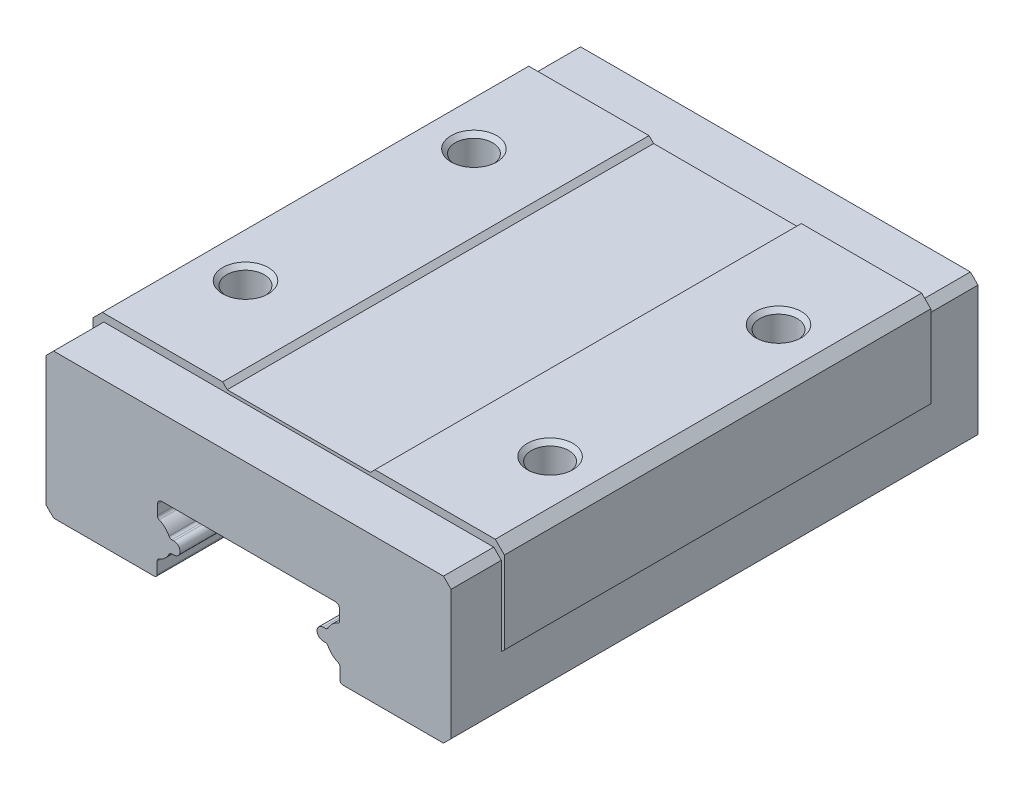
ISO-10303-21;
HEADER;
FILE_DESCRIPTION(('STEP AP214'),'2;1');
FILE_NAME('part.step','',(''),(''),'','','');
FILE_SCHEMA(('AUTOMOTIVE_DESIGN { 1 0 10303 214 1 1 1 1 }'));
ENDSEC;
DATA;
#1=APPLICATION_CONTEXT('core data for automotive mechanical design processes');
#2=APPLICATION_PROTOCOL_DEFINITION('international standard','automotive_design',2000,#1);
#3=PRODUCT_CONTEXT('',#1,'mechanical');
#4=PRODUCT('Part','Part','',(#3));
#5=PRODUCT_RELATED_PRODUCT_CATEGORY('part','',(#4));
#6=PRODUCT_DEFINITION_FORMATION('','',#4);
#7=PRODUCT_DEFINITION_CONTEXT('part definition',#1,'design');
#8=PRODUCT_DEFINITION('design','',#6,#7);
#9=PRODUCT_DEFINITION_SHAPE('','',#8);
#10=(LENGTH_UNIT() NAMED_UNIT(*) SI_UNIT(.MILLI.,.METRE.));
#11=(NAMED_UNIT(*) PLANE_ANGLE_UNIT() SI_UNIT($,.RADIAN.));
#12=(NAMED_UNIT(*) SI_UNIT($,.STERADIAN.) SOLID_ANGLE_UNIT());
#13=UNCERTAINTY_MEASURE_WITH_UNIT(LENGTH_MEASURE(1.E-05),#10,'distance_accuracy_value','');
#14=(GEOMETRIC_REPRESENTATION_CONTEXT(3) GLOBAL_UNCERTAINTY_ASSIGNED_CONTEXT((#13)) GLOBAL_UNIT_ASSIGNED_CONTEXT((#10,
#11,#12)) REPRESENTATION_CONTEXT('',''));
#15=CARTESIAN_POINT('',(0.,0.,0.));
#16=DIRECTION('',(0.,0.,1.));
#17=DIRECTION('',(1.,0.,0.));
#18=AXIS2_PLACEMENT_3D('',#15,#16,#17);
#19=CARTESIAN_POINT('',(-5.03989366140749,-8.14999,-34.6));
#20=DIRECTION('',(0.,-1.,0.));
#21=DIRECTION('',(0.,0.,-1.));
#22=AXIS2_PLACEMENT_3D('',#19,#20,#21);
#23=PLANE('',#22);
#24=DIRECTION('',(1.,0.,0.));
#25=VECTOR('',#24,1.);
#26=CARTESIAN_POINT('',(-5.03989366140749,-8.14999,-34.6));
#27=LINE('',#26,#25);
#28=CARTESIAN_POINT('',(-5.03989366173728,-8.14999,-34.6));
#29=VERTEX_POINT('',#28);
#30=CARTESIAN_POINT('',(-4.89999999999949,-8.14999,-34.6));
#31=VERTEX_POINT('',#30);
#32=EDGE_CURVE('E284',#29,#31,#27,.T.);
#33=ORIENTED_EDGE('',*,*,#32,.T.);
#34=DIRECTION('',(0.,0.,-1.));
#35=VECTOR('',#34,1.);
#36=CARTESIAN_POINT('',(-4.89999999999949,-8.14999,-34.6));
#37=LINE('',#36,#35);
#38=CARTESIAN_POINT('',(-4.89999999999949,-8.14999,0.));
#39=VERTEX_POINT('',#38);
#40=EDGE_CURVE('E239',#39,#31,#37,.T.);
#41=ORIENTED_EDGE('',*,*,#40,.F.);
#42=DIRECTION('',(1.,0.,0.));
#43=VECTOR('',#42,1.);
#44=CARTESIAN_POINT('',(-5.03989366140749,-8.14999,0.));
#45=LINE('',#44,#43);
#46=CARTESIAN_POINT('',(-5.03989366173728,-8.14999,0.));
#47=VERTEX_POINT('',#46);
#48=EDGE_CURVE('E235',#39,#47,#45,.F.);
#49=ORIENTED_EDGE('',*,*,#48,.T.);
#50=DIRECTION('',(0.,0.,-1.));
#51=VECTOR('',#50,1.);
#52=CARTESIAN_POINT('',(-5.03989366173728,-8.14999,-34.6));
#53=LINE('',#52,#51);
#54=EDGE_CURVE('E290',#47,#29,#53,.T.);
#55=ORIENTED_EDGE('',*,*,#54,.T.);
#56=EDGE_LOOP('',(#33,#41,#49,#55));
#57=FACE_BOUND('',#56,.T.);
#58=ADVANCED_FACE('F16',(#57),#23,.T.);
#59=CARTESIAN_POINT('',(4.9000000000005,-8.14999,-34.6));
#60=DIRECTION('',(0.,-1.,0.));
#61=DIRECTION('',(0.,0.,-1.));
#62=AXIS2_PLACEMENT_3D('',#59,#60,#61);
#63=PLANE('',#62);
#64=DIRECTION('',(1.,0.,0.));
#65=VECTOR('',#64,1.);
#66=CARTESIAN_POINT('',(4.9000000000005,-8.14999,-34.6));
#67=LINE('',#66,#65);
#68=CARTESIAN_POINT('',(4.9000000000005,-8.14999,-34.6));
#69=VERTEX_POINT('',#68);
#70=CARTESIAN_POINT('',(5.03989366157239,-8.14999,-34.6));
#71=VERTEX_POINT('',#70);
#72=EDGE_CURVE('E240',#69,#71,#67,.T.);
#73=ORIENTED_EDGE('',*,*,#72,.T.);
#74=DIRECTION('',(0.,0.,-1.));
#75=VECTOR('',#74,1.);
#76=CARTESIAN_POINT('',(5.0398936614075,-8.14999,-34.6));
#77=LINE('',#76,#75);
#78=CARTESIAN_POINT('',(5.03989366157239,-8.14999,0.));
#79=VERTEX_POINT('',#78);
#80=EDGE_CURVE('E285',#71,#79,#77,.F.);
#81=ORIENTED_EDGE('',*,*,#80,.T.);
#82=DIRECTION('',(1.,0.,0.));
#83=VECTOR('',#82,1.);
#84=CARTESIAN_POINT('',(4.9000000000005,-8.14999,0.));
#85=LINE('',#84,#83);
#86=CARTESIAN_POINT('',(4.9000000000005,-8.14999,0.));
#87=VERTEX_POINT('',#86);
#88=EDGE_CURVE('E281',#79,#87,#85,.F.);
#89=ORIENTED_EDGE('',*,*,#88,.T.);
#90=DIRECTION('',(0.,0.,-1.));
#91=VECTOR('',#90,1.);
#92=CARTESIAN_POINT('',(4.9000000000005,-8.14999,-34.6));
#93=LINE('',#92,#91);
#94=EDGE_CURVE('E255',#69,#87,#93,.F.);
#95=ORIENTED_EDGE('',*,*,#94,.F.);
#96=EDGE_LOOP('',(#73,#81,#89,#95));
#97=FACE_BOUND('',#96,.T.);
#98=ADVANCED_FACE('F1264',(#97),#63,.T.);
#99=CARTESIAN_POINT('',(-4.89999999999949,-7.74999,-34.6));
#100=DIRECTION('',(0.,0.,-1.));
#101=DIRECTION('',(-1.,0.,0.));
#102=AXIS2_PLACEMENT_3D('',#99,#100,#101);
#103=CYLINDRICAL_SURFACE('',#102,0.400000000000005);
#104=CARTESIAN_POINT('',(-4.89999999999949,-7.74999,-34.6));
#105=DIRECTION('',(0.,0.,-1.));
#106=DIRECTION('',(-1.,0.,0.));
#107=AXIS2_PLACEMENT_3D('',#104,#105,#106);
#108=CIRCLE('',#107,0.400000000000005);
#109=CARTESIAN_POINT('',(-4.89999999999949,-7.34999,-34.6));
#110=VERTEX_POINT('',#109);
#111=EDGE_CURVE('E245',#31,#110,#108,.F.);
#112=ORIENTED_EDGE('',*,*,#111,.T.);
#113=DIRECTION('',(0.,0.,1.));
#114=VECTOR('',#113,1.);
#115=CARTESIAN_POINT('',(-4.89999999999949,-7.34999,-34.6));
#116=LINE('',#115,#114);
#117=CARTESIAN_POINT('',(-4.89999999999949,-7.34999,0.));
#118=VERTEX_POINT('',#117);
#119=EDGE_CURVE('E242',#118,#110,#116,.F.);
#120=ORIENTED_EDGE('',*,*,#119,.F.);
#121=CARTESIAN_POINT('',(-4.89999999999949,-7.74999,0.));
#122=DIRECTION('',(0.,0.,-1.));
#123=DIRECTION('',(-1.,0.,0.));
#124=AXIS2_PLACEMENT_3D('',#121,#122,#123);
#125=CIRCLE('',#124,0.400000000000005);
#126=EDGE_CURVE('E19',#118,#39,#125,.T.);
#127=ORIENTED_EDGE('',*,*,#126,.T.);
#128=ORIENTED_EDGE('',*,*,#40,.T.);
#129=EDGE_LOOP('',(#112,#120,#127,#128));
#130=FACE_BOUND('',#129,.T.);
#131=ADVANCED_FACE('F243',(#130),#103,.T.);
#132=CARTESIAN_POINT('',(-5.03989366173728,-8.34999,-34.6));
#133=DIRECTION('',(0.,0.,-1.));
#134=DIRECTION('',(-1.,0.,0.));
#135=AXIS2_PLACEMENT_3D('',#132,#133,#134);
#136=CYLINDRICAL_SURFACE('',#135,0.2);
#137=DIRECTION('',(0.,0.,-1.));
#138=VECTOR('',#137,1.);
#139=CARTESIAN_POINT('',(-5.21857939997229,-8.26014899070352,-34.6));
#140=LINE('',#139,#138);
#141=CARTESIAN_POINT('',(-5.21857940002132,-8.26014899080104,-34.6));
#142=VERTEX_POINT('',#141);
#143=CARTESIAN_POINT('',(-5.21857940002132,-8.26014899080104,0.));
#144=VERTEX_POINT('',#143);
#145=EDGE_CURVE('E275',#142,#144,#140,.F.);
#146=ORIENTED_EDGE('',*,*,#145,.F.);
#147=CARTESIAN_POINT('',(-5.03989366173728,-8.34999,-34.6));
#148=DIRECTION('',(0.,0.,-1.));
#149=DIRECTION('',(-1.,0.,0.));
#150=AXIS2_PLACEMENT_3D('',#147,#148,#149);
#151=CIRCLE('',#150,0.2);
#152=EDGE_CURVE('E293',#29,#142,#151,.F.);
#153=ORIENTED_EDGE('',*,*,#152,.F.);
#154=ORIENTED_EDGE('',*,*,#54,.F.);
#155=CARTESIAN_POINT('',(-5.03989366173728,-8.34999,0.));
#156=DIRECTION('',(0.,0.,-1.));
#157=DIRECTION('',(-1.,0.,0.));
#158=AXIS2_PLACEMENT_3D('',#155,#156,#157);
#159=CIRCLE('',#158,0.2);
#160=EDGE_CURVE('E411',#144,#47,#159,.T.);
#161=ORIENTED_EDGE('',*,*,#160,.F.);
#162=EDGE_LOOP('',(#146,#153,#154,#161));
#163=FACE_BOUND('',#162,.T.);
#164=ADVANCED_FACE('F421',(#163),#136,.F.);
#165=CARTESIAN_POINT('',(5.03989366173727,-8.34999,-34.6));
#166=DIRECTION('',(0.,0.,-1.));
#167=DIRECTION('',(-1.,0.,0.));
#168=AXIS2_PLACEMENT_3D('',#165,#166,#167);
#169=CYLINDRICAL_SURFACE('',#168,0.2);
#170=ORIENTED_EDGE('',*,*,#80,.F.);
#171=CARTESIAN_POINT('',(5.03989366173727,-8.34999,-34.6));
#172=DIRECTION('',(0.,0.,-1.));
#173=DIRECTION('',(-1.,0.,0.));
#174=AXIS2_PLACEMENT_3D('',#171,#172,#173);
#175=CIRCLE('',#174,0.2);
#176=CARTESIAN_POINT('',(5.21857940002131,-8.26014899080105,-34.6));
#177=VERTEX_POINT('',#176);
#178=EDGE_CURVE('E289',#177,#71,#175,.F.);
#179=ORIENTED_EDGE('',*,*,#178,.F.);
#180=DIRECTION('',(0.,0.,-1.));
#181=VECTOR('',#180,1.);
#182=CARTESIAN_POINT('',(5.21857939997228,-8.26014899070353,-34.6));
#183=LINE('',#182,#181);
#184=CARTESIAN_POINT('',(5.21857940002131,-8.26014899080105,0.));
#185=VERTEX_POINT('',#184);
#186=EDGE_CURVE('E270',#185,#177,#183,.T.);
#187=ORIENTED_EDGE('',*,*,#186,.F.);
#188=CARTESIAN_POINT('',(5.03989366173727,-8.34999,0.));
#189=DIRECTION('',(0.,0.,-1.));
#190=DIRECTION('',(-1.,0.,0.));
#191=AXIS2_PLACEMENT_3D('',#188,#189,#190);
#192=CIRCLE('',#191,0.2);
#193=EDGE_CURVE('E288',#79,#185,#192,.T.);
#194=ORIENTED_EDGE('',*,*,#193,.F.);
#195=EDGE_LOOP('',(#170,#179,#187,#194));
#196=FACE_BOUND('',#195,.T.);
#197=ADVANCED_FACE('F873',(#196),#169,.F.);
#198=CARTESIAN_POINT('',(10.,-3.49999999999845,-24.8));
#199=DIRECTION('',(0.,1.,0.));
#200=DIRECTION('',(0.,0.,1.));
#201=AXIS2_PLACEMENT_3D('',#198,#199,#200);
#202=CONICAL_SURFACE('',#201,1.22949999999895,1.04719755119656);
#203=CARTESIAN_POINT('',(10.,-4.20985215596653,-24.8));
#204=VERTEX_POINT('',#203);
#205=VERTEX_LOOP('',#204);
#206=FACE_BOUND('',#205,.T.);
#207=CARTESIAN_POINT('',(10.,-3.5,-24.8));
#208=DIRECTION('',(0.,-1.,0.));
#209=DIRECTION('',(0.,0.,-1.));
#210=AXIS2_PLACEMENT_3D('',#207,#208,#209);
#211=CIRCLE('',#210,1.2295);
#212=CARTESIAN_POINT('',(10.,-3.5,-26.0295));
#213=VERTEX_POINT('',#212);
#214=EDGE_CURVE('E398',#213,#213,#211,.F.);
#215=ORIENTED_EDGE('',*,*,#214,.T.);
#216=EDGE_LOOP('',(#215));
#217=FACE_BOUND('',#216,.T.);
#218=ADVANCED_FACE('F1280',(#206,#217),#202,.F.);
#219=CARTESIAN_POINT('',(10.,-3.49999999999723,-9.8));
#220=DIRECTION('',(0.,1.,0.));
#221=DIRECTION('',(-1.,0.,0.));
#222=AXIS2_PLACEMENT_3D('',#219,#220,#221);
#223=CONICAL_SURFACE('',#222,1.22949999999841,1.04719755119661);
#224=CARTESIAN_POINT('',(10.,-4.20985215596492,-9.8));
#225=VERTEX_POINT('',#224);
#226=VERTEX_LOOP('',#225);
#227=FACE_BOUND('',#226,.T.);
#228=CARTESIAN_POINT('',(10.,-3.5,-9.8));
#229=DIRECTION('',(0.,-1.,0.));
#230=DIRECTION('',(0.,0.,-1.));
#231=AXIS2_PLACEMENT_3D('',#228,#229,#230);
#232=CIRCLE('',#231,1.2295);
#233=CARTESIAN_POINT('',(10.,-3.5,-11.0295));
#234=VERTEX_POINT('',#233);
#235=EDGE_CURVE('E848',#234,#234,#232,.F.);
#236=ORIENTED_EDGE('',*,*,#235,.T.);
#237=EDGE_LOOP('',(#236));
#238=FACE_BOUND('',#237,.T.);
#239=ADVANCED_FACE('F1283',(#227,#238),#223,.F.);
#240=CARTESIAN_POINT('',(-10.,-3.49999999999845,-24.8));
#241=DIRECTION('',(0.,1.,0.));
#242=DIRECTION('',(0.,0.,1.));
#243=AXIS2_PLACEMENT_3D('',#240,#241,#242);
#244=CONICAL_SURFACE('',#243,1.22949999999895,1.04719755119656);
#245=CARTESIAN_POINT('',(-10.,-4.20985215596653,-24.8));
#246=VERTEX_POINT('',#245);
#247=VERTEX_LOOP('',#246);
#248=FACE_BOUND('',#247,.T.);
#249=CARTESIAN_POINT('',(-10.,-3.5,-24.8));
#250=DIRECTION('',(0.,-1.,0.));
#251=DIRECTION('',(0.,0.,-1.));
#252=AXIS2_PLACEMENT_3D('',#249,#250,#251);
#253=CIRCLE('',#252,1.2295);
#254=CARTESIAN_POINT('',(-10.,-3.5,-26.0295));
#255=VERTEX_POINT('',#254);
#256=EDGE_CURVE('E843',#255,#255,#253,.F.);
#257=ORIENTED_EDGE('',*,*,#256,.T.);
#258=EDGE_LOOP('',(#257));
#259=FACE_BOUND('',#258,.T.);
#260=ADVANCED_FACE('F1287',(#248,#259),#244,.F.);
#261=CARTESIAN_POINT('',(-10.,-3.49999999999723,-9.8));
#262=DIRECTION('',(0.,1.,0.));
#263=DIRECTION('',(-1.,0.,0.));
#264=AXIS2_PLACEMENT_3D('',#261,#262,#263);
#265=CONICAL_SURFACE('',#264,1.2294999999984,1.0471975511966);
#266=CARTESIAN_POINT('',(-10.,-4.20985215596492,-9.8));
#267=VERTEX_POINT('',#266);
#268=VERTEX_LOOP('',#267);
#269=FACE_BOUND('',#268,.T.);
#270=CARTESIAN_POINT('',(-10.,-3.5,-9.8));
#271=DIRECTION('',(0.,-1.,0.));
#272=DIRECTION('',(0.,0.,-1.));
#273=AXIS2_PLACEMENT_3D('',#270,#271,#272);
#274=CIRCLE('',#273,1.2295);
#275=CARTESIAN_POINT('',(-10.,-3.5,-11.0295));
#276=VERTEX_POINT('',#275);
#277=EDGE_CURVE('E826',#276,#276,#274,.F.);
#278=ORIENTED_EDGE('',*,*,#277,.T.);
#279=EDGE_LOOP('',(#278));
#280=FACE_BOUND('',#279,.T.);
#281=ADVANCED_FACE('F1291',(#269,#280),#265,.F.);
#282=CARTESIAN_POINT('',(4.9000000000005,-7.74999,-34.6));
#283=DIRECTION('',(0.,0.,-1.));
#284=DIRECTION('',(-1.,0.,0.));
#285=AXIS2_PLACEMENT_3D('',#282,#283,#284);
#286=CYLINDRICAL_SURFACE('',#285,0.400000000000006);
#287=CARTESIAN_POINT('',(4.9000000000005,-7.74999,-34.6));
#288=DIRECTION('',(0.,0.,-1.));
#289=DIRECTION('',(-1.,0.,0.));
#290=AXIS2_PLACEMENT_3D('',#287,#288,#289);
#291=CIRCLE('',#290,0.400000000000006);
#292=CARTESIAN_POINT('',(4.9000000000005,-7.34999,-34.6));
#293=VERTEX_POINT('',#292);
#294=EDGE_CURVE('E258',#293,#69,#291,.F.);
#295=ORIENTED_EDGE('',*,*,#294,.T.);
#296=ORIENTED_EDGE('',*,*,#94,.T.);
#297=CARTESIAN_POINT('',(4.9000000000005,-7.74999,0.));
#298=DIRECTION('',(0.,0.,-1.));
#299=DIRECTION('',(-1.,0.,0.));
#300=AXIS2_PLACEMENT_3D('',#297,#298,#299);
#301=CIRCLE('',#300,0.400000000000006);
#302=CARTESIAN_POINT('',(4.9000000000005,-7.34999,0.));
#303=VERTEX_POINT('',#302);
#304=EDGE_CURVE('E406',#87,#303,#301,.T.);
#305=ORIENTED_EDGE('',*,*,#304,.T.);
#306=DIRECTION('',(0.,0.,1.));
#307=VECTOR('',#306,1.);
#308=CARTESIAN_POINT('',(4.9000000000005,-7.34999,-34.6));
#309=LINE('',#308,#307);
#310=EDGE_CURVE('E265',#293,#303,#309,.T.);
#311=ORIENTED_EDGE('',*,*,#310,.F.);
#312=EDGE_LOOP('',(#295,#296,#305,#311));
#313=FACE_BOUND('',#312,.T.);
#314=ADVANCED_FACE('F1295',(#313),#286,.T.);
#315=CARTESIAN_POINT('',(-4.89999999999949,-7.34999,-34.6));
#316=DIRECTION('',(0.,1.,0.));
#317=DIRECTION('',(0.,0.,1.));
#318=AXIS2_PLACEMENT_3D('',#315,#316,#317);
#319=PLANE('',#318);
#320=DIRECTION('',(1.,0.,0.));
#321=VECTOR('',#320,1.);
#322=CARTESIAN_POINT('',(-4.89999999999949,-7.34999,-34.6));
#323=LINE('',#322,#321);
#324=CARTESIAN_POINT('',(-5.03992071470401,-7.34999,-34.6));
#325=VERTEX_POINT('',#324);
#326=EDGE_CURVE('E249',#110,#325,#323,.F.);
#327=ORIENTED_EDGE('',*,*,#326,.T.);
#328=DIRECTION('',(0.,0.,-1.));
#329=VECTOR('',#328,1.);
#330=CARTESIAN_POINT('',(-5.03992071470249,-7.34999,-34.6));
#331=LINE('',#330,#329);
#332=CARTESIAN_POINT('',(-5.03992071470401,-7.34999,0.));
#333=VERTEX_POINT('',#332);
#334=EDGE_CURVE('E253',#325,#333,#331,.F.);
#335=ORIENTED_EDGE('',*,*,#334,.T.);
#336=DIRECTION('',(1.,0.,0.));
#337=VECTOR('',#336,1.);
#338=CARTESIAN_POINT('',(-4.89999999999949,-7.34999,0.));
#339=LINE('',#338,#337);
#340=EDGE_CURVE('E232',#333,#118,#339,.T.);
#341=ORIENTED_EDGE('',*,*,#340,.T.);
#342=ORIENTED_EDGE('',*,*,#119,.T.);
#343=EDGE_LOOP('',(#327,#335,#341,#342));
#344=FACE_BOUND('',#343,.T.);
#345=ADVANCED_FACE('F251',(#344),#319,.T.);
#346=CARTESIAN_POINT('',(-6.36752869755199,-7.68247130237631,-34.6));
#347=DIRECTION('',(0.,0.,-1.));
#348=DIRECTION('',(-1.,0.,0.));
#349=AXIS2_PLACEMENT_3D('',#346,#347,#348);
#350=CYLINDRICAL_SURFACE('',#349,1.28599999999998);
#351=CARTESIAN_POINT('',(-6.36752869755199,-7.68247130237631,-34.6));
#352=DIRECTION('',(0.,0.,-1.));
#353=DIRECTION('',(-1.,0.,0.));
#354=AXIS2_PLACEMENT_3D('',#351,#352,#353);
#355=CIRCLE('',#354,1.28599999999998);
#356=CARTESIAN_POINT('',(-5.87638352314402,-8.87098820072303,-34.6));
#357=VERTEX_POINT('',#356);
#358=EDGE_CURVE('E277',#357,#142,#355,.F.);
#359=ORIENTED_EDGE('',*,*,#358,.T.);
#360=ORIENTED_EDGE('',*,*,#145,.T.);
#361=CARTESIAN_POINT('',(-6.36752869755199,-7.68247130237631,0.));
#362=DIRECTION('',(0.,0.,-1.));
#363=DIRECTION('',(-1.,0.,0.));
#364=AXIS2_PLACEMENT_3D('',#361,#362,#363);
#365=CIRCLE('',#364,1.28599999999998);
#366=CARTESIAN_POINT('',(-5.87638352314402,-8.87098820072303,0.));
#367=VERTEX_POINT('',#366);
#368=EDGE_CURVE('E264',#144,#367,#365,.T.);
#369=ORIENTED_EDGE('',*,*,#368,.T.);
#370=DIRECTION('',(0.,0.,-1.));
#371=VECTOR('',#370,1.);
#372=CARTESIAN_POINT('',(-5.87638364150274,-8.87098824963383,-34.6));
#373=LINE('',#372,#371);
#374=EDGE_CURVE('E392',#367,#357,#373,.T.);
#375=ORIENTED_EDGE('',*,*,#374,.T.);
#376=EDGE_LOOP('',(#359,#360,#369,#375));
#377=FACE_BOUND('',#376,.T.);
#378=ADVANCED_FACE('F423',(#377),#350,.T.);
#379=CARTESIAN_POINT('',(6.367528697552,-7.68247130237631,-34.6));
#380=DIRECTION('',(0.,0.,-1.));
#381=DIRECTION('',(-1.,0.,0.));
#382=AXIS2_PLACEMENT_3D('',#379,#380,#381);
#383=CYLINDRICAL_SURFACE('',#382,1.286);
#384=CARTESIAN_POINT('',(6.367528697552,-7.68247130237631,-34.6));
#385=DIRECTION('',(0.,0.,-1.));
#386=DIRECTION('',(-1.,0.,0.));
#387=AXIS2_PLACEMENT_3D('',#384,#385,#386);
#388=CIRCLE('',#387,1.286);
#389=CARTESIAN_POINT('',(5.87638352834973,-8.87098820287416,-34.6));
#390=VERTEX_POINT('',#389);
#391=EDGE_CURVE('E273',#177,#390,#388,.F.);
#392=ORIENTED_EDGE('',*,*,#391,.T.);
#393=DIRECTION('',(0.,0.,-1.));
#394=VECTOR('',#393,1.);
#395=CARTESIAN_POINT('',(5.87638365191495,-8.87098825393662,-34.6));
#396=LINE('',#395,#394);
#397=CARTESIAN_POINT('',(5.87638352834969,-8.87098820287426,0.));
#398=VERTEX_POINT('',#397);
#399=EDGE_CURVE('E384',#390,#398,#396,.F.);
#400=ORIENTED_EDGE('',*,*,#399,.T.);
#401=CARTESIAN_POINT('',(6.367528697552,-7.68247130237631,0.));
#402=DIRECTION('',(0.,0.,-1.));
#403=DIRECTION('',(-1.,0.,0.));
#404=AXIS2_PLACEMENT_3D('',#401,#402,#403);
#405=CIRCLE('',#404,1.286);
#406=EDGE_CURVE('E274',#398,#185,#405,.T.);
#407=ORIENTED_EDGE('',*,*,#406,.T.);
#408=ORIENTED_EDGE('',*,*,#186,.T.);
#409=EDGE_LOOP('',(#392,#400,#407,#408));
#410=FACE_BOUND('',#409,.T.);
#411=ADVANCED_FACE('F863',(#410),#383,.T.);
#412=CARTESIAN_POINT('',(10.,0.,-24.8));
#413=DIRECTION('',(0.,-1.,0.));
#414=DIRECTION('',(0.,0.,-1.));
#415=AXIS2_PLACEMENT_3D('',#412,#413,#414);
#416=CYLINDRICAL_SURFACE('',#415,1.2295);
#417=ORIENTED_EDGE('',*,*,#214,.F.);
#418=EDGE_LOOP('',(#417));
#419=FACE_BOUND('',#418,.T.);
#420=CARTESIAN_POINT('',(10.,-0.270499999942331,-24.8));
#421=DIRECTION('',(0.,1.,0.));
#422=DIRECTION('',(0.,0.,1.));
#423=AXIS2_PLACEMENT_3D('',#420,#421,#422);
#424=CIRCLE('',#423,1.22950000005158);
#425=CARTESIAN_POINT('',(10.,-0.270499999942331,-23.5704999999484));
#426=VERTEX_POINT('',#425);
#427=EDGE_CURVE('E805',#426,#426,#424,.T.);
#428=ORIENTED_EDGE('',*,*,#427,.T.);
#429=EDGE_LOOP('',(#428));
#430=FACE_BOUND('',#429,.T.);
#431=ADVANCED_FACE('F1306',(#419,#430),#416,.F.);
#432=CARTESIAN_POINT('',(10.,0.,-9.8));
#433=DIRECTION('',(0.,-1.,0.));
#434=DIRECTION('',(0.,0.,-1.));
#435=AXIS2_PLACEMENT_3D('',#432,#433,#434);
#436=CYLINDRICAL_SURFACE('',#435,1.2295);
#437=ORIENTED_EDGE('',*,*,#235,.F.);
#438=EDGE_LOOP('',(#437));
#439=FACE_BOUND('',#438,.T.);
#440=CARTESIAN_POINT('',(10.,-0.270499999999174,-9.8));
#441=DIRECTION('',(0.,1.,0.));
#442=DIRECTION('',(0.,0.,1.));
#443=AXIS2_PLACEMENT_3D('',#440,#441,#442);
#444=CIRCLE('',#443,1.22949999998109);
#445=CARTESIAN_POINT('',(10.,-0.270499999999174,-8.57050000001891));
#446=VERTEX_POINT('',#445);
#447=EDGE_CURVE('E802',#446,#446,#444,.T.);
#448=ORIENTED_EDGE('',*,*,#447,.T.);
#449=EDGE_LOOP('',(#448));
#450=FACE_BOUND('',#449,.T.);
#451=ADVANCED_FACE('F1309',(#439,#450),#436,.F.);
#452=CARTESIAN_POINT('',(-10.,0.,-24.8));
#453=DIRECTION('',(0.,-1.,0.));
#454=DIRECTION('',(0.,0.,-1.));
#455=AXIS2_PLACEMENT_3D('',#452,#453,#454);
#456=CYLINDRICAL_SURFACE('',#455,1.2295);
#457=ORIENTED_EDGE('',*,*,#256,.F.);
#458=EDGE_LOOP('',(#457));
#459=FACE_BOUND('',#458,.T.);
#460=CARTESIAN_POINT('',(-10.,-0.270499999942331,-24.8));
#461=DIRECTION('',(0.,1.,0.));
#462=DIRECTION('',(0.,0.,1.));
#463=AXIS2_PLACEMENT_3D('',#460,#461,#462);
#464=CIRCLE('',#463,1.22950000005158);
#465=CARTESIAN_POINT('',(-10.,-0.270499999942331,-23.5704999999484));
#466=VERTEX_POINT('',#465);
#467=EDGE_CURVE('E783',#466,#466,#464,.T.);
#468=ORIENTED_EDGE('',*,*,#467,.T.);
#469=EDGE_LOOP('',(#468));
#470=FACE_BOUND('',#469,.T.);
#471=ADVANCED_FACE('F1313',(#459,#470),#456,.F.);
#472=CARTESIAN_POINT('',(-10.,0.,-9.8));
#473=DIRECTION('',(0.,-1.,0.));
#474=DIRECTION('',(0.,0.,-1.));
#475=AXIS2_PLACEMENT_3D('',#472,#473,#474);
#476=CYLINDRICAL_SURFACE('',#475,1.2295);
#477=ORIENTED_EDGE('',*,*,#277,.F.);
#478=EDGE_LOOP('',(#477));
#479=FACE_BOUND('',#478,.T.);
#480=CARTESIAN_POINT('',(-10.,-0.270499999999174,-9.8));
#481=DIRECTION('',(0.,1.,0.));
#482=DIRECTION('',(0.,0.,1.));
#483=AXIS2_PLACEMENT_3D('',#480,#481,#482);
#484=CIRCLE('',#483,1.22949999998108);
#485=CARTESIAN_POINT('',(-10.,-0.270499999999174,-8.57050000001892));
#486=VERTEX_POINT('',#485);
#487=EDGE_CURVE('E778',#486,#486,#484,.T.);
#488=ORIENTED_EDGE('',*,*,#487,.T.);
#489=EDGE_LOOP('',(#488));
#490=FACE_BOUND('',#489,.T.);
#491=ADVANCED_FACE('F1317',(#479,#490),#476,.F.);
#492=CARTESIAN_POINT('',(5.0399207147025,-7.34999,-34.6));
#493=DIRECTION('',(0.,1.,0.));
#494=DIRECTION('',(0.,0.,1.));
#495=AXIS2_PLACEMENT_3D('',#492,#493,#494);
#496=PLANE('',#495);
#497=DIRECTION('',(1.,0.,0.));
#498=VECTOR('',#497,1.);
#499=CARTESIAN_POINT('',(5.0399207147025,-7.34999,-34.6));
#500=LINE('',#499,#498);
#501=CARTESIAN_POINT('',(5.0399207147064,-7.34999,-34.6));
#502=VERTEX_POINT('',#501);
#503=EDGE_CURVE('E269',#502,#293,#500,.F.);
#504=ORIENTED_EDGE('',*,*,#503,.T.);
#505=ORIENTED_EDGE('',*,*,#310,.T.);
#506=DIRECTION('',(1.,0.,0.));
#507=VECTOR('',#506,1.);
#508=CARTESIAN_POINT('',(5.0399207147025,-7.34999,0.));
#509=LINE('',#508,#507);
#510=CARTESIAN_POINT('',(5.0399207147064,-7.34999,0.));
#511=VERTEX_POINT('',#510);
#512=EDGE_CURVE('E824',#303,#511,#509,.T.);
#513=ORIENTED_EDGE('',*,*,#512,.T.);
#514=DIRECTION('',(0.,0.,-1.));
#515=VECTOR('',#514,1.);
#516=CARTESIAN_POINT('',(5.0399207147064,-7.34999,-34.6));
#517=LINE('',#516,#515);
#518=EDGE_CURVE('E371',#511,#502,#517,.T.);
#519=ORIENTED_EDGE('',*,*,#518,.T.);
#520=EDGE_LOOP('',(#504,#505,#513,#519));
#521=FACE_BOUND('',#520,.T.);
#522=ADVANCED_FACE('F1236',(#521),#496,.T.);
#523=CARTESIAN_POINT('',(-5.03992071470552,-7.14999,-34.6));
#524=DIRECTION('',(0.,0.,-1.));
#525=DIRECTION('',(-1.,0.,0.));
#526=AXIS2_PLACEMENT_3D('',#523,#524,#525);
#527=CYLINDRICAL_SURFACE('',#526,0.200000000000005);
#528=ORIENTED_EDGE('',*,*,#334,.F.);
#529=CARTESIAN_POINT('',(-5.03992071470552,-7.14999,-34.6));
#530=DIRECTION('',(0.,0.,-1.));
#531=DIRECTION('',(-1.,0.,0.));
#532=AXIS2_PLACEMENT_3D('',#529,#530,#531);
#533=CIRCLE('',#532,0.200000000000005);
#534=CARTESIAN_POINT('',(-5.21861033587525,-7.23982328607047,-34.6));
#535=VERTEX_POINT('',#534);
#536=EDGE_CURVE('E268',#535,#325,#533,.F.);
#537=ORIENTED_EDGE('',*,*,#536,.F.);
#538=DIRECTION('',(0.,0.,-1.));
#539=VECTOR('',#538,1.);
#540=CARTESIAN_POINT('',(-5.21861033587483,-7.23982328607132,-34.6));
#541=LINE('',#540,#539);
#542=CARTESIAN_POINT('',(-5.21861033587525,-7.23982328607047,0.));
#543=VERTEX_POINT('',#542);
#544=EDGE_CURVE('E362',#543,#535,#541,.T.);
#545=ORIENTED_EDGE('',*,*,#544,.F.);
#546=CARTESIAN_POINT('',(-5.03992071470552,-7.14999,0.));
#547=DIRECTION('',(0.,0.,-1.));
#548=DIRECTION('',(-1.,0.,0.));
#549=AXIS2_PLACEMENT_3D('',#546,#547,#548);
#550=CIRCLE('',#549,0.200000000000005);
#551=EDGE_CURVE('E393',#333,#543,#550,.T.);
#552=ORIENTED_EDGE('',*,*,#551,.F.);
#553=EDGE_LOOP('',(#528,#537,#545,#552));
#554=FACE_BOUND('',#553,.T.);
#555=ADVANCED_FACE('F1261',(#554),#527,.F.);
#556=CARTESIAN_POINT('',(-5.8000000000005,-9.05582747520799,-34.6));
#557=DIRECTION('',(0.,0.,-1.));
#558=DIRECTION('',(-1.,0.,0.));
#559=AXIS2_PLACEMENT_3D('',#556,#557,#558);
#560=CYLINDRICAL_SURFACE('',#559,0.2);
#561=DIRECTION('',(0.,0.,-1.));
#562=VECTOR('',#561,1.);
#563=CARTESIAN_POINT('',(-6.0000000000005,-9.05582747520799,-34.6));
#564=LINE('',#563,#562);
#565=CARTESIAN_POINT('',(-6.0000000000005,-9.05582747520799,-34.6));
#566=VERTEX_POINT('',#565);
#567=CARTESIAN_POINT('',(-6.0000000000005,-9.05582747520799,0.));
#568=VERTEX_POINT('',#567);
#569=EDGE_CURVE('E431',#566,#568,#564,.F.);
#570=ORIENTED_EDGE('',*,*,#569,.F.);
#571=CARTESIAN_POINT('',(-5.8000000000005,-9.05582747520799,-34.6));
#572=DIRECTION('',(0.,0.,-1.));
#573=DIRECTION('',(-1.,0.,0.));
#574=AXIS2_PLACEMENT_3D('',#571,#572,#573);
#575=CIRCLE('',#574,0.2);
#576=EDGE_CURVE('E390',#357,#566,#575,.F.);
#577=ORIENTED_EDGE('',*,*,#576,.F.);
#578=ORIENTED_EDGE('',*,*,#374,.F.);
#579=CARTESIAN_POINT('',(-5.8000000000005,-9.05582747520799,0.));
#580=DIRECTION('',(0.,0.,-1.));
#581=DIRECTION('',(-1.,0.,0.));
#582=AXIS2_PLACEMENT_3D('',#579,#580,#581);
#583=CIRCLE('',#582,0.2);
#584=EDGE_CURVE('E387',#568,#367,#583,.T.);
#585=ORIENTED_EDGE('',*,*,#584,.F.);
#586=EDGE_LOOP('',(#570,#577,#578,#585));
#587=FACE_BOUND('',#586,.T.);
#588=ADVANCED_FACE('F429',(#587),#560,.F.);
#589=CARTESIAN_POINT('',(5.79999999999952,-9.05582747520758,-34.6));
#590=DIRECTION('',(0.,0.,-1.));
#591=DIRECTION('',(-1.,0.,0.));
#592=AXIS2_PLACEMENT_3D('',#589,#590,#591);
#593=CYLINDRICAL_SURFACE('',#592,0.199999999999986);
#594=ORIENTED_EDGE('',*,*,#399,.F.);
#595=CARTESIAN_POINT('',(5.79999999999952,-9.05582747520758,-34.6));
#596=DIRECTION('',(0.,0.,-1.));
#597=DIRECTION('',(-1.,0.,0.));
#598=AXIS2_PLACEMENT_3D('',#595,#596,#597);
#599=CIRCLE('',#598,0.199999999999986);
#600=CARTESIAN_POINT('',(5.9999999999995,-9.05582747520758,-34.6));
#601=VERTEX_POINT('',#600);
#602=EDGE_CURVE('E385',#601,#390,#599,.F.);
#603=ORIENTED_EDGE('',*,*,#602,.F.);
#604=DIRECTION('',(0.,0.,1.));
#605=VECTOR('',#604,1.);
#606=CARTESIAN_POINT('',(5.9999999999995,-9.05582747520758,-34.6));
#607=LINE('',#606,#605);
#608=CARTESIAN_POINT('',(5.9999999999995,-9.05582747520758,0.));
#609=VERTEX_POINT('',#608);
#610=EDGE_CURVE('E762',#609,#601,#607,.F.);
#611=ORIENTED_EDGE('',*,*,#610,.F.);
#612=CARTESIAN_POINT('',(5.79999999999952,-9.05582747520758,0.));
#613=DIRECTION('',(0.,0.,-1.));
#614=DIRECTION('',(-1.,0.,0.));
#615=AXIS2_PLACEMENT_3D('',#612,#613,#614);
#616=CIRCLE('',#615,0.199999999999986);
#617=EDGE_CURVE('E381',#398,#609,#616,.T.);
#618=ORIENTED_EDGE('',*,*,#617,.F.);
#619=EDGE_LOOP('',(#594,#603,#611,#618));
#620=FACE_BOUND('',#619,.T.);
#621=ADVANCED_FACE('F867',(#620),#593,.F.);
#622=CARTESIAN_POINT('',(13.4999999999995,-0.6,-34.6));
#623=DIRECTION('',(0.707106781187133,0.707106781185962,0.));
#624=DIRECTION('',(-0.707106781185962,0.707106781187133,0.));
#625=AXIS2_PLACEMENT_3D('',#622,#623,#624);
#626=PLANE('',#625);
#627=DIRECTION('',(-0.707106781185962,0.707106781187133,0.));
#628=VECTOR('',#627,1.);
#629=CARTESIAN_POINT('',(13.4999999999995,-0.6,-3.3));
#630=LINE('',#629,#628);
#631=CARTESIAN_POINT('',(12.9000000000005,0.,-3.3));
#632=VERTEX_POINT('',#631);
#633=CARTESIAN_POINT('',(13.4999999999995,-0.6,-3.3));
#634=VERTEX_POINT('',#633);
#635=EDGE_CURVE('E810',#632,#634,#630,.F.);
#636=ORIENTED_EDGE('',*,*,#635,.T.);
#637=DIRECTION('',(0.,0.,-1.));
#638=VECTOR('',#637,1.);
#639=CARTESIAN_POINT('',(13.4999999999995,-0.6,-34.6));
#640=LINE('',#639,#638);
#641=CARTESIAN_POINT('',(13.4999999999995,-0.6,-31.3));
#642=VERTEX_POINT('',#641);
#643=EDGE_CURVE('E720',#642,#634,#640,.F.);
#644=ORIENTED_EDGE('',*,*,#643,.F.);
#645=DIRECTION('',(-0.707106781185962,0.707106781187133,0.));
#646=VECTOR('',#645,1.);
#647=CARTESIAN_POINT('',(13.4999999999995,-0.6,-31.3));
#648=LINE('',#647,#646);
#649=CARTESIAN_POINT('',(12.9000000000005,0.,-31.3));
#650=VERTEX_POINT('',#649);
#651=EDGE_CURVE('E383',#642,#650,#648,.T.);
#652=ORIENTED_EDGE('',*,*,#651,.T.);
#653=DIRECTION('',(0.,0.,1.));
#654=VECTOR('',#653,1.);
#655=CARTESIAN_POINT('',(12.9000000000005,0.,-34.6));
#656=LINE('',#655,#654);
#657=EDGE_CURVE('E357',#632,#650,#656,.F.);
#658=ORIENTED_EDGE('',*,*,#657,.F.);
#659=EDGE_LOOP('',(#636,#644,#652,#658));
#660=FACE_BOUND('',#659,.T.);
#661=ADVANCED_FACE('F1080',(#660),#626,.T.);
#662=CARTESIAN_POINT('',(10.,-5.6843418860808E-11,-24.8));
#663=DIRECTION('',(0.,1.,0.));
#664=DIRECTION('',(0.,0.,1.));
#665=AXIS2_PLACEMENT_3D('',#662,#663,#664);
#666=CONICAL_SURFACE('',#665,1.49999999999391,0.785398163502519);
#667=ORIENTED_EDGE('',*,*,#427,.F.);
#668=EDGE_LOOP('',(#667));
#669=FACE_BOUND('',#668,.T.);
#670=CARTESIAN_POINT('',(10.,-5.6843418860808E-11,-24.8));
#671=DIRECTION('',(0.,1.,0.));
#672=DIRECTION('',(0.,0.,1.));
#673=AXIS2_PLACEMENT_3D('',#670,#671,#672);
#674=CIRCLE('',#673,1.49999999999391);
#675=CARTESIAN_POINT('',(10.,-5.6843418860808E-11,-23.3000000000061));
#676=VERTEX_POINT('',#675);
#677=EDGE_CURVE('E354',#676,#676,#674,.F.);
#678=ORIENTED_EDGE('',*,*,#677,.F.);
#679=EDGE_LOOP('',(#678));
#680=FACE_BOUND('',#679,.T.);
#681=ADVANCED_FACE('F1332',(#669,#680),#666,.F.);
#682=CARTESIAN_POINT('',(10.,0.,-9.8));
#683=DIRECTION('',(0.,1.,0.));
#684=DIRECTION('',(0.,0.,1.));
#685=AXIS2_PLACEMENT_3D('',#682,#683,#684);
#686=CONICAL_SURFACE('',#685,1.49999999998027,0.785398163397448);
#687=ORIENTED_EDGE('',*,*,#447,.F.);
#688=EDGE_LOOP('',(#687));
#689=FACE_BOUND('',#688,.T.);
#690=CARTESIAN_POINT('',(10.,0.,-9.8));
#691=DIRECTION('',(0.,1.,0.));
#692=DIRECTION('',(0.,0.,1.));
#693=AXIS2_PLACEMENT_3D('',#690,#691,#692);
#694=CIRCLE('',#693,1.49999999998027);
#695=CARTESIAN_POINT('',(10.,0.,-8.30000000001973));
#696=VERTEX_POINT('',#695);
#697=EDGE_CURVE('E350',#696,#696,#694,.F.);
#698=ORIENTED_EDGE('',*,*,#697,.F.);
#699=EDGE_LOOP('',(#698));
#700=FACE_BOUND('',#699,.T.);
#701=ADVANCED_FACE('F1335',(#689,#700),#686,.F.);
#702=CARTESIAN_POINT('',(4.9999999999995,0.,-34.6));
#703=DIRECTION('',(-0.707106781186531,0.707106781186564,0.));
#704=DIRECTION('',(-0.707106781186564,-0.707106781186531,0.));
#705=AXIS2_PLACEMENT_3D('',#702,#703,#704);
#706=PLANE('',#705);
#707=DIRECTION('',(-0.707106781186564,-0.707106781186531,0.));
#708=VECTOR('',#707,1.);
#709=CARTESIAN_POINT('',(4.9999999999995,0.,-3.3));
#710=LINE('',#709,#708);
#711=CARTESIAN_POINT('',(4.69999999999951,-0.299999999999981,-3.3));
#712=VERTEX_POINT('',#711);
#713=CARTESIAN_POINT('',(4.9999999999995,0.,-3.3));
#714=VERTEX_POINT('',#713);
#715=EDGE_CURVE('E796',#712,#714,#710,.F.);
#716=ORIENTED_EDGE('',*,*,#715,.T.);
#717=DIRECTION('',(0.,0.,1.));
#718=VECTOR('',#717,1.);
#719=CARTESIAN_POINT('',(4.9999999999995,0.,-34.6));
#720=LINE('',#719,#718);
#721=CARTESIAN_POINT('',(4.9999999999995,0.,-31.3));
#722=VERTEX_POINT('',#721);
#723=EDGE_CURVE('E717',#722,#714,#720,.T.);
#724=ORIENTED_EDGE('',*,*,#723,.F.);
#725=DIRECTION('',(-0.707106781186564,-0.707106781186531,0.));
#726=VECTOR('',#725,1.);
#727=CARTESIAN_POINT('',(4.9999999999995,0.,-31.3));
#728=LINE('',#727,#726);
#729=CARTESIAN_POINT('',(4.69999999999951,-0.299999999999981,-31.3));
#730=VERTEX_POINT('',#729);
#731=EDGE_CURVE('E799',#722,#730,#728,.T.);
#732=ORIENTED_EDGE('',*,*,#731,.T.);
#733=DIRECTION('',(0.,0.,1.));
#734=VECTOR('',#733,1.);
#735=CARTESIAN_POINT('',(4.69999999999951,-0.299999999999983,-34.6));
#736=LINE('',#735,#734);
#737=EDGE_CURVE('E710',#712,#730,#736,.F.);
#738=ORIENTED_EDGE('',*,*,#737,.F.);
#739=EDGE_LOOP('',(#716,#724,#732,#738));
#740=FACE_BOUND('',#739,.T.);
#741=ADVANCED_FACE('F1089',(#740),#706,.T.);
#742=CARTESIAN_POINT('',(-4.69999999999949,-0.299999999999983,-34.6));
#743=DIRECTION('',(0.707106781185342,0.707106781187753,0.));
#744=DIRECTION('',(-0.707106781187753,0.707106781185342,0.));
#745=AXIS2_PLACEMENT_3D('',#742,#743,#744);
#746=PLANE('',#745);
#747=DIRECTION('',(-0.707106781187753,0.707106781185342,0.));
#748=VECTOR('',#747,1.);
#749=CARTESIAN_POINT('',(-4.69999999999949,-0.299999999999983,-3.3));
#750=LINE('',#749,#748);
#751=CARTESIAN_POINT('',(-5.0000000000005,0.,-3.3));
#752=VERTEX_POINT('',#751);
#753=CARTESIAN_POINT('',(-4.69999999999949,-0.299999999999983,-3.3));
#754=VERTEX_POINT('',#753);
#755=EDGE_CURVE('E788',#752,#754,#750,.F.);
#756=ORIENTED_EDGE('',*,*,#755,.T.);
#757=DIRECTION('',(0.,0.,1.));
#758=VECTOR('',#757,1.);
#759=CARTESIAN_POINT('',(-4.69999999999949,-0.299999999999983,-34.6));
#760=LINE('',#759,#758);
#761=CARTESIAN_POINT('',(-4.69999999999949,-0.299999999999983,-31.3));
#762=VERTEX_POINT('',#761);
#763=EDGE_CURVE('E353',#762,#754,#760,.T.);
#764=ORIENTED_EDGE('',*,*,#763,.F.);
#765=DIRECTION('',(-0.707106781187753,0.707106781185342,0.));
#766=VECTOR('',#765,1.);
#767=CARTESIAN_POINT('',(-4.69999999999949,-0.299999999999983,-31.3));
#768=LINE('',#767,#766);
#769=CARTESIAN_POINT('',(-5.0000000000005,0.,-31.3));
#770=VERTEX_POINT('',#769);
#771=EDGE_CURVE('E793',#762,#770,#768,.T.);
#772=ORIENTED_EDGE('',*,*,#771,.T.);
#773=DIRECTION('',(0.,0.,1.));
#774=VECTOR('',#773,1.);
#775=CARTESIAN_POINT('',(-5.0000000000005,0.,-34.6));
#776=LINE('',#775,#774);
#777=EDGE_CURVE('E349',#752,#770,#776,.F.);
#778=ORIENTED_EDGE('',*,*,#777,.F.);
#779=EDGE_LOOP('',(#756,#764,#772,#778));
#780=FACE_BOUND('',#779,.T.);
#781=ADVANCED_FACE('F1095',(#780),#746,.T.);
#782=CARTESIAN_POINT('',(-10.,-5.6843418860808E-11,-24.8));
#783=DIRECTION('',(0.,1.,0.));
#784=DIRECTION('',(0.,0.,1.));
#785=AXIS2_PLACEMENT_3D('',#782,#783,#784);
#786=CONICAL_SURFACE('',#785,1.49999999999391,0.785398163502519);
#787=ORIENTED_EDGE('',*,*,#467,.F.);
#788=EDGE_LOOP('',(#787));
#789=FACE_BOUND('',#788,.T.);
#790=CARTESIAN_POINT('',(-10.,-5.6843418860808E-11,-24.8));
#791=DIRECTION('',(0.,1.,0.));
#792=DIRECTION('',(0.,0.,1.));
#793=AXIS2_PLACEMENT_3D('',#790,#791,#792);
#794=CIRCLE('',#793,1.49999999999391);
#795=CARTESIAN_POINT('',(-10.,-5.6843418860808E-11,-23.3000000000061));
#796=VERTEX_POINT('',#795);
#797=EDGE_CURVE('E346',#796,#796,#794,.F.);
#798=ORIENTED_EDGE('',*,*,#797,.F.);
#799=EDGE_LOOP('',(#798));
#800=FACE_BOUND('',#799,.T.);
#801=ADVANCED_FACE('F1113',(#789,#800),#786,.F.);
#802=CARTESIAN_POINT('',(-10.,0.,-9.8));
#803=DIRECTION('',(0.,1.,0.));
#804=DIRECTION('',(0.,0.,1.));
#805=AXIS2_PLACEMENT_3D('',#802,#803,#804);
#806=CONICAL_SURFACE('',#805,1.49999999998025,0.785398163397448);
#807=ORIENTED_EDGE('',*,*,#487,.F.);
#808=EDGE_LOOP('',(#807));
#809=FACE_BOUND('',#808,.T.);
#810=CARTESIAN_POINT('',(-10.,0.,-9.8));
#811=DIRECTION('',(0.,1.,0.));
#812=DIRECTION('',(0.,0.,1.));
#813=AXIS2_PLACEMENT_3D('',#810,#811,#812);
#814=CIRCLE('',#813,1.49999999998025);
#815=CARTESIAN_POINT('',(-10.,0.,-8.30000000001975));
#816=VERTEX_POINT('',#815);
#817=EDGE_CURVE('E342',#816,#816,#814,.F.);
#818=ORIENTED_EDGE('',*,*,#817,.F.);
#819=EDGE_LOOP('',(#818));
#820=FACE_BOUND('',#819,.T.);
#821=ADVANCED_FACE('F1103',(#809,#820),#806,.F.);
#822=CARTESIAN_POINT('',(-12.9,0.,-34.6));
#823=DIRECTION('',(-0.707106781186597,0.707106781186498,0.));
#824=DIRECTION('',(-0.707106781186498,-0.707106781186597,0.));
#825=AXIS2_PLACEMENT_3D('',#822,#823,#824);
#826=PLANE('',#825);
#827=DIRECTION('',(-0.707106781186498,-0.707106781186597,0.));
#828=VECTOR('',#827,1.);
#829=CARTESIAN_POINT('',(-12.9,0.,-3.3));
#830=LINE('',#829,#828);
#831=CARTESIAN_POINT('',(-13.5,-0.599999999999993,-3.3));
#832=VERTEX_POINT('',#831);
#833=CARTESIAN_POINT('',(-12.9,0.,-3.3));
#834=VERTEX_POINT('',#833);
#835=EDGE_CURVE('E380',#832,#834,#830,.F.);
#836=ORIENTED_EDGE('',*,*,#835,.T.);
#837=DIRECTION('',(0.,0.,1.));
#838=VECTOR('',#837,1.);
#839=CARTESIAN_POINT('',(-12.9,0.,-34.6));
#840=LINE('',#839,#838);
#841=CARTESIAN_POINT('',(-12.9,0.,-31.3));
#842=VERTEX_POINT('',#841);
#843=EDGE_CURVE('E709',#842,#834,#840,.T.);
#844=ORIENTED_EDGE('',*,*,#843,.F.);
#845=DIRECTION('',(-0.707106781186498,-0.707106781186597,0.));
#846=VECTOR('',#845,1.);
#847=CARTESIAN_POINT('',(-12.9,0.,-31.3));
#848=LINE('',#847,#846);
#849=CARTESIAN_POINT('',(-13.5,-0.599999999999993,-31.3));
#850=VERTEX_POINT('',#849);
#851=EDGE_CURVE('E773',#842,#850,#848,.T.);
#852=ORIENTED_EDGE('',*,*,#851,.T.);
#853=DIRECTION('',(0.,0.,1.));
#854=VECTOR('',#853,1.);
#855=CARTESIAN_POINT('',(-13.5,-0.6,-34.6));
#856=LINE('',#855,#854);
#857=EDGE_CURVE('E692',#832,#850,#856,.F.);
#858=ORIENTED_EDGE('',*,*,#857,.F.);
#859=EDGE_LOOP('',(#836,#844,#852,#858));
#860=FACE_BOUND('',#859,.T.);
#861=ADVANCED_FACE('F1101',(#860),#826,.T.);
#862=CARTESIAN_POINT('',(-13.8,-3.,-34.6));
#863=DIRECTION('',(0.,0.,-1.));
#864=DIRECTION('',(-1.,0.,0.));
#865=AXIS2_PLACEMENT_3D('',#862,#863,#864);
#866=CYLINDRICAL_SURFACE('',#865,0.5);
#867=CARTESIAN_POINT('',(-13.8,-3.,-31.3));
#868=DIRECTION('',(0.,0.,-1.));
#869=DIRECTION('',(-1.,0.,0.));
#870=AXIS2_PLACEMENT_3D('',#867,#868,#869);
#871=CIRCLE('',#870,0.5);
#872=CARTESIAN_POINT('',(-13.5,-3.4,-31.3));
#873=VERTEX_POINT('',#872);
#874=CARTESIAN_POINT('',(-13.3,-3.,-31.3));
#875=VERTEX_POINT('',#874);
#876=EDGE_CURVE('E374',#873,#875,#871,.F.);
#877=ORIENTED_EDGE('',*,*,#876,.F.);
#878=DIRECTION('',(0.,0.,1.));
#879=VECTOR('',#878,1.);
#880=CARTESIAN_POINT('',(-13.5,-3.4,-34.6));
#881=LINE('',#880,#879);
#882=CARTESIAN_POINT('',(-13.5,-3.4,-3.3));
#883=VERTEX_POINT('',#882);
#884=EDGE_CURVE('E341',#883,#873,#881,.F.);
#885=ORIENTED_EDGE('',*,*,#884,.F.);
#886=CARTESIAN_POINT('',(-13.8,-3.,-3.3));
#887=DIRECTION('',(0.,0.,-1.));
#888=DIRECTION('',(-1.,0.,0.));
#889=AXIS2_PLACEMENT_3D('',#886,#887,#888);
#890=CIRCLE('',#889,0.5);
#891=CARTESIAN_POINT('',(-13.3,-3.,-3.3));
#892=VERTEX_POINT('',#891);
#893=EDGE_CURVE('E376',#892,#883,#890,.T.);
#894=ORIENTED_EDGE('',*,*,#893,.F.);
#895=CARTESIAN_POINT('',(-13.8,-3.,-3.3));
#896=DIRECTION('',(0.,0.,-1.));
#897=DIRECTION('',(-1.,0.,0.));
#898=AXIS2_PLACEMENT_3D('',#895,#896,#897);
#899=CIRCLE('',#898,0.5);
#900=CARTESIAN_POINT('',(-13.5,-2.6,-3.3));
#901=VERTEX_POINT('',#900);
#902=EDGE_CURVE('E378',#901,#892,#899,.T.);
#903=ORIENTED_EDGE('',*,*,#902,.F.);
#904=DIRECTION('',(0.,0.,1.));
#905=VECTOR('',#904,1.);
#906=CARTESIAN_POINT('',(-13.5,-2.6,-34.6));
#907=LINE('',#906,#905);
#908=CARTESIAN_POINT('',(-13.5,-2.6,-31.3));
#909=VERTEX_POINT('',#908);
#910=EDGE_CURVE('E345',#909,#901,#907,.T.);
#911=ORIENTED_EDGE('',*,*,#910,.F.);
#912=CARTESIAN_POINT('',(-13.8,-3.,-31.3));
#913=DIRECTION('',(0.,0.,-1.));
#914=DIRECTION('',(-1.,0.,0.));
#915=AXIS2_PLACEMENT_3D('',#912,#913,#914);
#916=CIRCLE('',#915,0.5);
#917=EDGE_CURVE('E372',#875,#909,#916,.F.);
#918=ORIENTED_EDGE('',*,*,#917,.F.);
#919=EDGE_LOOP('',(#877,#885,#894,#903,#911,#918));
#920=FACE_BOUND('',#919,.T.);
#921=ADVANCED_FACE('F1026',(#920),#866,.F.);
#922=CARTESIAN_POINT('',(5.0399207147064,-7.14999,-34.6));
#923=DIRECTION('',(0.,0.,-1.));
#924=DIRECTION('',(-1.,0.,0.));
#925=AXIS2_PLACEMENT_3D('',#922,#923,#924);
#926=CYLINDRICAL_SURFACE('',#925,0.199999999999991);
#927=DIRECTION('',(0.,0.,-1.));
#928=VECTOR('',#927,1.);
#929=CARTESIAN_POINT('',(5.21861033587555,-7.23982328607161,-34.6));
#930=LINE('',#929,#928);
#931=CARTESIAN_POINT('',(5.21861033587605,-7.23982328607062,-34.6));
#932=VERTEX_POINT('',#931);
#933=CARTESIAN_POINT('',(5.21861033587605,-7.23982328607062,0.));
#934=VERTEX_POINT('',#933);
#935=EDGE_CURVE('E335',#932,#934,#930,.F.);
#936=ORIENTED_EDGE('',*,*,#935,.F.);
#937=CARTESIAN_POINT('',(5.0399207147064,-7.14999,-34.6));
#938=DIRECTION('',(0.,0.,-1.));
#939=DIRECTION('',(-1.,0.,0.));
#940=AXIS2_PLACEMENT_3D('',#937,#938,#939);
#941=CIRCLE('',#940,0.199999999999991);
#942=EDGE_CURVE('E369',#502,#932,#941,.F.);
#943=ORIENTED_EDGE('',*,*,#942,.F.);
#944=ORIENTED_EDGE('',*,*,#518,.F.);
#945=CARTESIAN_POINT('',(5.0399207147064,-7.14999,0.));
#946=DIRECTION('',(0.,0.,-1.));
#947=DIRECTION('',(-1.,0.,0.));
#948=AXIS2_PLACEMENT_3D('',#945,#946,#947);
#949=CIRCLE('',#948,0.199999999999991);
#950=EDGE_CURVE('E366',#934,#511,#949,.T.);
#951=ORIENTED_EDGE('',*,*,#950,.F.);
#952=EDGE_LOOP('',(#936,#943,#944,#951));
#953=FACE_BOUND('',#952,.T.);
#954=ADVANCED_FACE('F1111',(#953),#926,.F.);
#955=CARTESIAN_POINT('',(-6.36731656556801,-7.81731656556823,-34.6));
#956=DIRECTION('',(0.,0.,-1.));
#957=DIRECTION('',(-1.,0.,0.));
#958=AXIS2_PLACEMENT_3D('',#955,#956,#957);
#959=CYLINDRICAL_SURFACE('',#958,1.2857);
#960=CARTESIAN_POINT('',(-6.36731656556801,-7.81731656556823,-34.6));
#961=DIRECTION('',(0.,0.,-1.));
#962=DIRECTION('',(-1.,0.,0.));
#963=AXIS2_PLACEMENT_3D('',#960,#961,#962);
#964=CIRCLE('',#963,1.2857);
#965=CARTESIAN_POINT('',(-5.86555318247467,-6.63356912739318,-34.6));
#966=VERTEX_POINT('',#965);
#967=EDGE_CURVE('E358',#535,#966,#964,.F.);
#968=ORIENTED_EDGE('',*,*,#967,.T.);
#969=DIRECTION('',(0.,0.,-1.));
#970=VECTOR('',#969,1.);
#971=CARTESIAN_POINT('',(-5.86555338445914,-6.63356904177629,-34.6));
#972=LINE('',#971,#970);
#973=CARTESIAN_POINT('',(-5.86555318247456,-6.63356912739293,0.));
#974=VERTEX_POINT('',#973);
#975=EDGE_CURVE('E332',#966,#974,#972,.F.);
#976=ORIENTED_EDGE('',*,*,#975,.T.);
#977=CARTESIAN_POINT('',(-6.36731656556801,-7.81731656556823,0.));
#978=DIRECTION('',(0.,0.,-1.));
#979=DIRECTION('',(-1.,0.,0.));
#980=AXIS2_PLACEMENT_3D('',#977,#978,#979);
#981=CIRCLE('',#980,1.2857);
#982=EDGE_CURVE('E363',#974,#543,#981,.T.);
#983=ORIENTED_EDGE('',*,*,#982,.T.);
#984=ORIENTED_EDGE('',*,*,#544,.T.);
#985=EDGE_LOOP('',(#968,#976,#983,#984));
#986=FACE_BOUND('',#985,.T.);
#987=ADVANCED_FACE('F1218',(#986),#959,.T.);
#988=CARTESIAN_POINT('',(-6.0000000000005,-9.79999,-34.6));
#989=DIRECTION('',(1.,0.,0.));
#990=DIRECTION('',(0.,0.,-1.));
#991=AXIS2_PLACEMENT_3D('',#988,#989,#990);
#992=PLANE('',#991);
#993=DIRECTION('',(0.,1.,0.));
#994=VECTOR('',#993,1.);
#995=CARTESIAN_POINT('',(-6.0000000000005,-9.79999,-34.6));
#996=LINE('',#995,#994);
#997=CARTESIAN_POINT('',(-6.0000000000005,-9.79999,-34.6));
#998=VERTEX_POINT('',#997);
#999=EDGE_CURVE('E433',#998,#566,#996,.T.);
#1000=ORIENTED_EDGE('',*,*,#999,.T.);
#1001=ORIENTED_EDGE('',*,*,#569,.T.);
#1002=DIRECTION('',(0.,1.,0.));
#1003=VECTOR('',#1002,1.);
#1004=CARTESIAN_POINT('',(-6.0000000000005,-9.79999,0.));
#1005=LINE('',#1004,#1003);
#1006=CARTESIAN_POINT('',(-6.0000000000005,-9.79999,0.));
#1007=VERTEX_POINT('',#1006);
#1008=EDGE_CURVE('E361',#568,#1007,#1005,.F.);
#1009=ORIENTED_EDGE('',*,*,#1008,.T.);
#1010=DIRECTION('',(0.,0.,-1.));
#1011=VECTOR('',#1010,1.);
#1012=CARTESIAN_POINT('',(-6.00000000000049,-9.79999,-34.6));
#1013=LINE('',#1012,#1011);
#1014=EDGE_CURVE('E324',#998,#1007,#1013,.F.);
#1015=ORIENTED_EDGE('',*,*,#1014,.F.);
#1016=EDGE_LOOP('',(#1000,#1001,#1009,#1015));
#1017=FACE_BOUND('',#1016,.T.);
#1018=ADVANCED_FACE('F441',(#1017),#992,.T.);
#1019=CARTESIAN_POINT('',(5.9999999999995,-9.05582747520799,-34.6));
#1020=DIRECTION('',(-1.,0.,0.));
#1021=DIRECTION('',(0.,0.,1.));
#1022=AXIS2_PLACEMENT_3D('',#1019,#1020,#1021);
#1023=PLANE('',#1022);
#1024=DIRECTION('',(0.,1.,0.));
#1025=VECTOR('',#1024,1.);
#1026=CARTESIAN_POINT('',(5.9999999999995,-9.05582747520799,-34.6));
#1027=LINE('',#1026,#1025);
#1028=CARTESIAN_POINT('',(5.9999999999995,-9.79999,-34.6));
#1029=VERTEX_POINT('',#1028);
#1030=EDGE_CURVE('E723',#601,#1029,#1027,.F.);
#1031=ORIENTED_EDGE('',*,*,#1030,.T.);
#1032=DIRECTION('',(0.,0.,-1.));
#1033=VECTOR('',#1032,1.);
#1034=CARTESIAN_POINT('',(5.9999999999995,-9.79999,-34.6));
#1035=LINE('',#1034,#1033);
#1036=CARTESIAN_POINT('',(5.9999999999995,-9.79999,0.));
#1037=VERTEX_POINT('',#1036);
#1038=EDGE_CURVE('E320',#1037,#1029,#1035,.T.);
#1039=ORIENTED_EDGE('',*,*,#1038,.F.);
#1040=DIRECTION('',(0.,1.,0.));
#1041=VECTOR('',#1040,1.);
#1042=CARTESIAN_POINT('',(5.9999999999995,-9.05582747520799,0.));
#1043=LINE('',#1042,#1041);
#1044=EDGE_CURVE('E763',#1037,#609,#1043,.T.);
#1045=ORIENTED_EDGE('',*,*,#1044,.T.);
#1046=ORIENTED_EDGE('',*,*,#610,.T.);
#1047=EDGE_LOOP('',(#1031,#1039,#1045,#1046));
#1048=FACE_BOUND('',#1047,.T.);
#1049=ADVANCED_FACE('F878',(#1048),#1023,.T.);
#1050=CARTESIAN_POINT('',(13.4999999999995,-6.,-34.6));
#1051=DIRECTION('',(1.,0.,0.));
#1052=DIRECTION('',(0.,0.,-1.));
#1053=AXIS2_PLACEMENT_3D('',#1050,#1051,#1052);
#1054=PLANE('',#1053);
#1055=DIRECTION('',(0.,1.,0.));
#1056=VECTOR('',#1055,1.);
#1057=CARTESIAN_POINT('',(13.4999999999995,0.,-3.3));
#1058=LINE('',#1057,#1056);
#1059=CARTESIAN_POINT('',(13.4999999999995,-6.,-3.3));
#1060=VERTEX_POINT('',#1059);
#1061=EDGE_CURVE('E582',#1060,#634,#1058,.T.);
#1062=ORIENTED_EDGE('',*,*,#1061,.F.);
#1063=DIRECTION('',(0.,0.,1.));
#1064=VECTOR('',#1063,1.);
#1065=CARTESIAN_POINT('',(13.4999999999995,-6.,-34.6));
#1066=LINE('',#1065,#1064);
#1067=CARTESIAN_POINT('',(13.4999999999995,-6.,-31.3));
#1068=VERTEX_POINT('',#1067);
#1069=EDGE_CURVE('E664',#1068,#1060,#1066,.T.);
#1070=ORIENTED_EDGE('',*,*,#1069,.F.);
#1071=DIRECTION('',(0.,1.,0.));
#1072=VECTOR('',#1071,1.);
#1073=CARTESIAN_POINT('',(13.4999999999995,0.,-31.3));
#1074=LINE('',#1073,#1072);
#1075=EDGE_CURVE('E626',#1068,#642,#1074,.T.);
#1076=ORIENTED_EDGE('',*,*,#1075,.T.);
#1077=ORIENTED_EDGE('',*,*,#643,.T.);
#1078=EDGE_LOOP('',(#1062,#1070,#1076,#1077));
#1079=FACE_BOUND('',#1078,.T.);
#1080=ADVANCED_FACE('F1077',(#1079),#1054,.T.);
#1081=CARTESIAN_POINT('',(12.9000000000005,0.,-34.6));
#1082=DIRECTION('',(0.,1.,0.));
#1083=DIRECTION('',(0.,0.,1.));
#1084=AXIS2_PLACEMENT_3D('',#1081,#1082,#1083);
#1085=PLANE('',#1084);
#1086=ORIENTED_EDGE('',*,*,#697,.T.);
#1087=EDGE_LOOP('',(#1086));
#1088=FACE_BOUND('',#1087,.T.);
#1089=ORIENTED_EDGE('',*,*,#677,.T.);
#1090=EDGE_LOOP('',(#1089));
#1091=FACE_BOUND('',#1090,.T.);
#1092=DIRECTION('',(1.,0.,0.));
#1093=VECTOR('',#1092,1.);
#1094=CARTESIAN_POINT('',(0.,0.,-3.3));
#1095=LINE('',#1094,#1093);
#1096=EDGE_CURVE('E579',#632,#714,#1095,.F.);
#1097=ORIENTED_EDGE('',*,*,#1096,.F.);
#1098=ORIENTED_EDGE('',*,*,#657,.T.);
#1099=DIRECTION('',(1.,0.,0.));
#1100=VECTOR('',#1099,1.);
#1101=CARTESIAN_POINT('',(0.,0.,-31.3));
#1102=LINE('',#1101,#1100);
#1103=EDGE_CURVE('E623',#650,#722,#1102,.F.);
#1104=ORIENTED_EDGE('',*,*,#1103,.T.);
#1105=ORIENTED_EDGE('',*,*,#723,.T.);
#1106=EDGE_LOOP('',(#1097,#1098,#1104,#1105));
#1107=FACE_BOUND('',#1106,.T.);
#1108=ADVANCED_FACE('F1084',(#1088,#1091,#1107),#1085,.T.);
#1109=CARTESIAN_POINT('',(4.69999999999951,-0.299999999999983,-34.6));
#1110=DIRECTION('',(0.,1.,0.));
#1111=DIRECTION('',(0.,0.,1.));
#1112=AXIS2_PLACEMENT_3D('',#1109,#1110,#1111);
#1113=PLANE('',#1112);
#1114=DIRECTION('',(1.,0.,0.));
#1115=VECTOR('',#1114,1.);
#1116=CARTESIAN_POINT('',(0.,-0.299999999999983,-3.3));
#1117=LINE('',#1116,#1115);
#1118=EDGE_CURVE('E576',#712,#754,#1117,.F.);
#1119=ORIENTED_EDGE('',*,*,#1118,.F.);
#1120=ORIENTED_EDGE('',*,*,#737,.T.);
#1121=DIRECTION('',(1.,0.,0.));
#1122=VECTOR('',#1121,1.);
#1123=CARTESIAN_POINT('',(0.,-0.299999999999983,-31.3));
#1124=LINE('',#1123,#1122);
#1125=EDGE_CURVE('E620',#730,#762,#1124,.F.);
#1126=ORIENTED_EDGE('',*,*,#1125,.T.);
#1127=ORIENTED_EDGE('',*,*,#763,.T.);
#1128=EDGE_LOOP('',(#1119,#1120,#1126,#1127));
#1129=FACE_BOUND('',#1128,.T.);
#1130=ADVANCED_FACE('F1092',(#1129),#1113,.T.);
#1131=CARTESIAN_POINT('',(-5.0000000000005,0.,-34.6));
#1132=DIRECTION('',(0.,1.,0.));
#1133=DIRECTION('',(0.,0.,1.));
#1134=AXIS2_PLACEMENT_3D('',#1131,#1132,#1133);
#1135=PLANE('',#1134);
#1136=ORIENTED_EDGE('',*,*,#817,.T.);
#1137=EDGE_LOOP('',(#1136));
#1138=FACE_BOUND('',#1137,.T.);
#1139=ORIENTED_EDGE('',*,*,#797,.T.);
#1140=EDGE_LOOP('',(#1139));
#1141=FACE_BOUND('',#1140,.T.);
#1142=DIRECTION('',(1.,0.,0.));
#1143=VECTOR('',#1142,1.);
#1144=CARTESIAN_POINT('',(0.,0.,-3.3));
#1145=LINE('',#1144,#1143);
#1146=EDGE_CURVE('E573',#752,#834,#1145,.F.);
#1147=ORIENTED_EDGE('',*,*,#1146,.F.);
#1148=ORIENTED_EDGE('',*,*,#777,.T.);
#1149=DIRECTION('',(1.,0.,0.));
#1150=VECTOR('',#1149,1.);
#1151=CARTESIAN_POINT('',(0.,0.,-31.3));
#1152=LINE('',#1151,#1150);
#1153=EDGE_CURVE('E617',#770,#842,#1152,.F.);
#1154=ORIENTED_EDGE('',*,*,#1153,.T.);
#1155=ORIENTED_EDGE('',*,*,#843,.T.);
#1156=EDGE_LOOP('',(#1147,#1148,#1154,#1155));
#1157=FACE_BOUND('',#1156,.T.);
#1158=ADVANCED_FACE('F1099',(#1138,#1141,#1157),#1135,.T.);
#1159=CARTESIAN_POINT('',(-13.5,-0.6,-34.6));
#1160=DIRECTION('',(-1.,0.,0.));
#1161=DIRECTION('',(0.,0.,1.));
#1162=AXIS2_PLACEMENT_3D('',#1159,#1160,#1161);
#1163=PLANE('',#1162);
#1164=DIRECTION('',(0.,1.,0.));
#1165=VECTOR('',#1164,1.);
#1166=CARTESIAN_POINT('',(-13.5,0.,-3.3));
#1167=LINE('',#1166,#1165);
#1168=EDGE_CURVE('E570',#832,#901,#1167,.F.);
#1169=ORIENTED_EDGE('',*,*,#1168,.F.);
#1170=ORIENTED_EDGE('',*,*,#857,.T.);
#1171=DIRECTION('',(0.,1.,0.));
#1172=VECTOR('',#1171,1.);
#1173=CARTESIAN_POINT('',(-13.5,0.,-31.3));
#1174=LINE('',#1173,#1172);
#1175=EDGE_CURVE('E614',#850,#909,#1174,.F.);
#1176=ORIENTED_EDGE('',*,*,#1175,.T.);
#1177=ORIENTED_EDGE('',*,*,#910,.T.);
#1178=EDGE_LOOP('',(#1169,#1170,#1176,#1177));
#1179=FACE_BOUND('',#1178,.T.);
#1180=ADVANCED_FACE('F1045',(#1179),#1163,.T.);
#1181=CARTESIAN_POINT('',(-13.5,-3.4,-34.6));
#1182=DIRECTION('',(-1.,0.,0.));
#1183=DIRECTION('',(0.,0.,1.));
#1184=AXIS2_PLACEMENT_3D('',#1181,#1182,#1183);
#1185=PLANE('',#1184);
#1186=DIRECTION('',(0.,1.,0.));
#1187=VECTOR('',#1186,1.);
#1188=CARTESIAN_POINT('',(-13.5,0.,-3.3));
#1189=LINE('',#1188,#1187);
#1190=CARTESIAN_POINT('',(-13.5,-6.,-3.3));
#1191=VERTEX_POINT('',#1190);
#1192=EDGE_CURVE('E536',#883,#1191,#1189,.F.);
#1193=ORIENTED_EDGE('',*,*,#1192,.F.);
#1194=ORIENTED_EDGE('',*,*,#884,.T.);
#1195=DIRECTION('',(0.,1.,0.));
#1196=VECTOR('',#1195,1.);
#1197=CARTESIAN_POINT('',(-13.5,0.,-31.3));
#1198=LINE('',#1197,#1196);
#1199=CARTESIAN_POINT('',(-13.5,-6.,-31.3));
#1200=VERTEX_POINT('',#1199);
#1201=EDGE_CURVE('E648',#873,#1200,#1198,.F.);
#1202=ORIENTED_EDGE('',*,*,#1201,.T.);
#1203=DIRECTION('',(0.,0.,1.));
#1204=VECTOR('',#1203,1.);
#1205=CARTESIAN_POINT('',(-13.5,-6.,-34.6));
#1206=LINE('',#1205,#1204);
#1207=EDGE_CURVE('E651',#1191,#1200,#1206,.F.);
#1208=ORIENTED_EDGE('',*,*,#1207,.F.);
#1209=EDGE_LOOP('',(#1193,#1194,#1202,#1208));
#1210=FACE_BOUND('',#1209,.T.);
#1211=ADVANCED_FACE('F1015',(#1210),#1185,.T.);
#1212=CARTESIAN_POINT('',(6.36731656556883,-7.81731656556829,-34.6));
#1213=DIRECTION('',(0.,0.,-1.));
#1214=DIRECTION('',(-1.,0.,0.));
#1215=AXIS2_PLACEMENT_3D('',#1212,#1213,#1214);
#1216=CYLINDRICAL_SURFACE('',#1215,1.2857);
#1217=CARTESIAN_POINT('',(6.36731656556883,-7.81731656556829,-34.6));
#1218=DIRECTION('',(0.,0.,-1.));
#1219=DIRECTION('',(-1.,0.,0.));
#1220=AXIS2_PLACEMENT_3D('',#1217,#1218,#1219);
#1221=CIRCLE('',#1220,1.2857);
#1222=CARTESIAN_POINT('',(5.8655527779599,-6.63356929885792,-34.6));
#1223=VERTEX_POINT('',#1222);
#1224=EDGE_CURVE('E336',#1223,#932,#1221,.F.);
#1225=ORIENTED_EDGE('',*,*,#1224,.T.);
#1226=ORIENTED_EDGE('',*,*,#935,.T.);
#1227=CARTESIAN_POINT('',(6.36731656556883,-7.81731656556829,0.));
#1228=DIRECTION('',(0.,0.,-1.));
#1229=DIRECTION('',(-1.,0.,0.));
#1230=AXIS2_PLACEMENT_3D('',#1227,#1228,#1229);
#1231=CIRCLE('',#1230,1.2857);
#1232=CARTESIAN_POINT('',(5.8655527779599,-6.63356929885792,0.));
#1233=VERTEX_POINT('',#1232);
#1234=EDGE_CURVE('E339',#934,#1233,#1231,.T.);
#1235=ORIENTED_EDGE('',*,*,#1234,.T.);
#1236=DIRECTION('',(0.,0.,-1.));
#1237=VECTOR('',#1236,1.);
#1238=CARTESIAN_POINT('',(5.86555257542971,-6.63356938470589,-34.6));
#1239=LINE('',#1238,#1237);
#1240=EDGE_CURVE('E316',#1233,#1223,#1239,.T.);
#1241=ORIENTED_EDGE('',*,*,#1240,.T.);
#1242=EDGE_LOOP('',(#1225,#1226,#1235,#1241));
#1243=FACE_BOUND('',#1242,.T.);
#1244=ADVANCED_FACE('F1195',(#1243),#1216,.T.);
#1245=CARTESIAN_POINT('',(-5.78750000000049,-6.44942868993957,-34.6));
#1246=DIRECTION('',(0.,0.,-1.));
#1247=DIRECTION('',(-1.,0.,0.));
#1248=AXIS2_PLACEMENT_3D('',#1245,#1246,#1247);
#1249=CYLINDRICAL_SURFACE('',#1248,0.200000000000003);
#1250=ORIENTED_EDGE('',*,*,#975,.F.);
#1251=CARTESIAN_POINT('',(-5.78750000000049,-6.44942868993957,-34.6));
#1252=DIRECTION('',(0.,0.,-1.));
#1253=DIRECTION('',(-1.,0.,0.));
#1254=AXIS2_PLACEMENT_3D('',#1251,#1252,#1253);
#1255=CIRCLE('',#1254,0.200000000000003);
#1256=CARTESIAN_POINT('',(-5.9875000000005,-6.44942868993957,-34.6));
#1257=VERTEX_POINT('',#1256);
#1258=EDGE_CURVE('E333',#1257,#966,#1255,.F.);
#1259=ORIENTED_EDGE('',*,*,#1258,.F.);
#1260=DIRECTION('',(0.,0.,-1.));
#1261=VECTOR('',#1260,1.);
#1262=CARTESIAN_POINT('',(-5.9875000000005,-6.44942868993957,-34.6));
#1263=LINE('',#1262,#1261);
#1264=CARTESIAN_POINT('',(-5.9875000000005,-6.44942868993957,0.));
#1265=VERTEX_POINT('',#1264);
#1266=EDGE_CURVE('E529',#1265,#1257,#1263,.T.);
#1267=ORIENTED_EDGE('',*,*,#1266,.F.);
#1268=CARTESIAN_POINT('',(-5.78750000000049,-6.44942868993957,0.));
#1269=DIRECTION('',(0.,0.,-1.));
#1270=DIRECTION('',(-1.,0.,0.));
#1271=AXIS2_PLACEMENT_3D('',#1268,#1269,#1270);
#1272=CIRCLE('',#1271,0.200000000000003);
#1273=EDGE_CURVE('E330',#974,#1265,#1272,.T.);
#1274=ORIENTED_EDGE('',*,*,#1273,.F.);
#1275=EDGE_LOOP('',(#1250,#1259,#1267,#1274));
#1276=FACE_BOUND('',#1275,.T.);
#1277=ADVANCED_FACE('F1192',(#1276),#1249,.F.);
#1278=CARTESIAN_POINT('',(-6.20000000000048,-9.79999,-34.6));
#1279=DIRECTION('',(0.,0.,-1.));
#1280=DIRECTION('',(-1.,0.,0.));
#1281=AXIS2_PLACEMENT_3D('',#1278,#1279,#1280);
#1282=CYLINDRICAL_SURFACE('',#1281,0.199999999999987);
#1283=CARTESIAN_POINT('',(-6.20000000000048,-9.79999,-34.6));
#1284=DIRECTION('',(0.,0.,-1.));
#1285=DIRECTION('',(-1.,0.,0.));
#1286=AXIS2_PLACEMENT_3D('',#1283,#1284,#1285);
#1287=CIRCLE('',#1286,0.199999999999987);
#1288=CARTESIAN_POINT('',(-6.2,-9.99999,-34.6));
#1289=VERTEX_POINT('',#1288);
#1290=EDGE_CURVE('E325',#1289,#998,#1287,.F.);
#1291=ORIENTED_EDGE('',*,*,#1290,.T.);
#1292=ORIENTED_EDGE('',*,*,#1014,.T.);
#1293=CARTESIAN_POINT('',(-6.20000000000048,-9.79999,0.));
#1294=DIRECTION('',(0.,0.,-1.));
#1295=DIRECTION('',(-1.,0.,0.));
#1296=AXIS2_PLACEMENT_3D('',#1293,#1294,#1295);
#1297=CIRCLE('',#1296,0.199999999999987);
#1298=CARTESIAN_POINT('',(-6.2,-9.99999,0.));
#1299=VERTEX_POINT('',#1298);
#1300=EDGE_CURVE('E328',#1007,#1299,#1297,.T.);
#1301=ORIENTED_EDGE('',*,*,#1300,.T.);
#1302=DIRECTION('',(0.,0.,-1.));
#1303=VECTOR('',#1302,1.);
#1304=CARTESIAN_POINT('',(-6.19999999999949,-9.99999,-34.6));
#1305=LINE('',#1304,#1303);
#1306=EDGE_CURVE('E446',#1289,#1299,#1305,.F.);
#1307=ORIENTED_EDGE('',*,*,#1306,.F.);
#1308=EDGE_LOOP('',(#1291,#1292,#1301,#1307));
#1309=FACE_BOUND('',#1308,.T.);
#1310=ADVANCED_FACE('F444',(#1309),#1282,.T.);
#1311=CARTESIAN_POINT('',(6.1999999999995,-9.79999,-34.6));
#1312=DIRECTION('',(0.,0.,-1.));
#1313=DIRECTION('',(-1.,0.,0.));
#1314=AXIS2_PLACEMENT_3D('',#1311,#1312,#1313);
#1315=CYLINDRICAL_SURFACE('',#1314,0.2);
#1316=CARTESIAN_POINT('',(6.1999999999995,-9.79999,-34.6));
#1317=DIRECTION('',(0.,0.,-1.));
#1318=DIRECTION('',(-1.,0.,0.));
#1319=AXIS2_PLACEMENT_3D('',#1316,#1317,#1318);
#1320=CIRCLE('',#1319,0.2);
#1321=CARTESIAN_POINT('',(6.1999999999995,-9.99999,-34.6));
#1322=VERTEX_POINT('',#1321);
#1323=EDGE_CURVE('E317',#1029,#1322,#1320,.F.);
#1324=ORIENTED_EDGE('',*,*,#1323,.T.);
#1325=DIRECTION('',(0.,0.,-1.));
#1326=VECTOR('',#1325,1.);
#1327=CARTESIAN_POINT('',(6.1999999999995,-9.99999,-34.6));
#1328=LINE('',#1327,#1326);
#1329=CARTESIAN_POINT('',(6.1999999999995,-9.99999,0.));
#1330=VERTEX_POINT('',#1329);
#1331=EDGE_CURVE('E451',#1330,#1322,#1328,.T.);
#1332=ORIENTED_EDGE('',*,*,#1331,.F.);
#1333=CARTESIAN_POINT('',(6.1999999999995,-9.79999,0.));
#1334=DIRECTION('',(0.,0.,-1.));
#1335=DIRECTION('',(-1.,0.,0.));
#1336=AXIS2_PLACEMENT_3D('',#1333,#1334,#1335);
#1337=CIRCLE('',#1336,0.2);
#1338=EDGE_CURVE('E321',#1330,#1037,#1337,.T.);
#1339=ORIENTED_EDGE('',*,*,#1338,.T.);
#1340=ORIENTED_EDGE('',*,*,#1038,.T.);
#1341=EDGE_LOOP('',(#1324,#1332,#1339,#1340));
#1342=FACE_BOUND('',#1341,.T.);
#1343=ADVANCED_FACE('F881',(#1342),#1315,.T.);
#1344=CARTESIAN_POINT('',(12.8000000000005,-9.99999,-34.6));
#1345=DIRECTION('',(0.707106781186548,-0.707106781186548,0.));
#1346=DIRECTION('',(0.707106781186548,0.707106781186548,0.));
#1347=AXIS2_PLACEMENT_3D('',#1344,#1345,#1346);
#1348=PLANE('',#1347);
#1349=DIRECTION('',(0.707106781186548,0.707106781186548,0.));
#1350=VECTOR('',#1349,1.);
#1351=CARTESIAN_POINT('',(12.8000000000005,-9.99999,-34.6));
#1352=LINE('',#1351,#1350);
#1353=CARTESIAN_POINT('',(12.8000000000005,-9.99999,-34.6));
#1354=VERTEX_POINT('',#1353);
#1355=CARTESIAN_POINT('',(13.3000000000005,-9.49999,-34.6));
#1356=VERTEX_POINT('',#1355);
#1357=EDGE_CURVE('E667',#1354,#1356,#1352,.T.);
#1358=ORIENTED_EDGE('',*,*,#1357,.T.);
#1359=DIRECTION('',(0.,0.,-1.));
#1360=VECTOR('',#1359,1.);
#1361=CARTESIAN_POINT('',(13.3000000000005,-9.49999,-34.6));
#1362=LINE('',#1361,#1360);
#1363=CARTESIAN_POINT('',(13.3000000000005,-9.49999,0.));
#1364=VERTEX_POINT('',#1363);
#1365=EDGE_CURVE('E510',#1364,#1356,#1362,.T.);
#1366=ORIENTED_EDGE('',*,*,#1365,.F.);
#1367=DIRECTION('',(0.707106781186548,0.707106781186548,0.));
#1368=VECTOR('',#1367,1.);
#1369=CARTESIAN_POINT('',(12.8000000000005,-9.99999,0.));
#1370=LINE('',#1369,#1368);
#1371=CARTESIAN_POINT('',(12.8000000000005,-9.99999,0.));
#1372=VERTEX_POINT('',#1371);
#1373=EDGE_CURVE('E319',#1364,#1372,#1370,.F.);
#1374=ORIENTED_EDGE('',*,*,#1373,.T.);
#1375=DIRECTION('',(0.,0.,-1.));
#1376=VECTOR('',#1375,1.);
#1377=CARTESIAN_POINT('',(12.8000000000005,-9.99999,-34.6));
#1378=LINE('',#1377,#1376);
#1379=EDGE_CURVE('E513',#1354,#1372,#1378,.F.);
#1380=ORIENTED_EDGE('',*,*,#1379,.F.);
#1381=EDGE_LOOP('',(#1358,#1366,#1374,#1380));
#1382=FACE_BOUND('',#1381,.T.);
#1383=ADVANCED_FACE('F892',(#1382),#1348,.T.);
#1384=CARTESIAN_POINT('',(13.3000000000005,-6.2,-34.6));
#1385=DIRECTION('',(0.707106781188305,-0.70710678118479,0.));
#1386=DIRECTION('',(0.70710678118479,0.707106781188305,0.));
#1387=AXIS2_PLACEMENT_3D('',#1384,#1385,#1386);
#1388=PLANE('',#1387);
#1389=DIRECTION('',(0.707106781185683,0.707106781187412,0.));
#1390=VECTOR('',#1389,1.);
#1391=CARTESIAN_POINT('',(13.3,-6.2,-3.3));
#1392=LINE('',#1391,#1390);
#1393=CARTESIAN_POINT('',(13.3000000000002,-6.20000000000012,-3.3));
#1394=VERTEX_POINT('',#1393);
#1395=EDGE_CURVE('E540',#1394,#1060,#1392,.T.);
#1396=ORIENTED_EDGE('',*,*,#1395,.F.);
#1397=DIRECTION('',(0.,0.,-1.));
#1398=VECTOR('',#1397,1.);
#1399=CARTESIAN_POINT('',(13.3000000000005,-6.2,-34.6));
#1400=LINE('',#1399,#1398);
#1401=CARTESIAN_POINT('',(13.3000000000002,-6.2,-31.3));
#1402=VERTEX_POINT('',#1401);
#1403=EDGE_CURVE('E501',#1402,#1394,#1400,.F.);
#1404=ORIENTED_EDGE('',*,*,#1403,.F.);
#1405=DIRECTION('',(0.707106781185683,0.707106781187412,0.));
#1406=VECTOR('',#1405,1.);
#1407=CARTESIAN_POINT('',(13.3,-6.2,-31.3));
#1408=LINE('',#1407,#1406);
#1409=EDGE_CURVE('E608',#1402,#1068,#1408,.T.);
#1410=ORIENTED_EDGE('',*,*,#1409,.T.);
#1411=ORIENTED_EDGE('',*,*,#1069,.T.);
#1412=EDGE_LOOP('',(#1396,#1404,#1410,#1411));
#1413=FACE_BOUND('',#1412,.T.);
#1414=ADVANCED_FACE('F1073',(#1413),#1388,.T.);
#1415=CARTESIAN_POINT('',(13.3,-0.99999,-3.3));
#1416=DIRECTION('',(0.707106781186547,0.707106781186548,0.));
#1417=DIRECTION('',(-0.707106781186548,0.707106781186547,0.));
#1418=AXIS2_PLACEMENT_3D('',#1415,#1416,#1417);
#1419=PLANE('',#1418);
#1420=DIRECTION('',(0.707106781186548,-0.707106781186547,0.));
#1421=VECTOR('',#1420,1.);
#1422=CARTESIAN_POINT('',(12.8,-0.49999,-3.3));
#1423=LINE('',#1422,#1421);
#1424=CARTESIAN_POINT('',(12.8,-0.49999,-3.3));
#1425=VERTEX_POINT('',#1424);
#1426=CARTESIAN_POINT('',(13.3000000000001,-0.99999,-3.3));
#1427=VERTEX_POINT('',#1426);
#1428=EDGE_CURVE('E566',#1425,#1427,#1423,.T.);
#1429=ORIENTED_EDGE('',*,*,#1428,.F.);
#1430=DIRECTION('',(0.,0.,1.));
#1431=VECTOR('',#1430,1.);
#1432=CARTESIAN_POINT('',(12.8,-0.49999,-3.3));
#1433=LINE('',#1432,#1431);
#1434=CARTESIAN_POINT('',(12.8,-0.49999,0.));
#1435=VERTEX_POINT('',#1434);
#1436=EDGE_CURVE('E313',#1435,#1425,#1433,.F.);
#1437=ORIENTED_EDGE('',*,*,#1436,.F.);
#1438=DIRECTION('',(-0.707106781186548,0.707106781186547,0.));
#1439=VECTOR('',#1438,1.);
#1440=CARTESIAN_POINT('',(13.3,-0.99999,0.));
#1441=LINE('',#1440,#1439);
#1442=CARTESIAN_POINT('',(13.3000000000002,-0.999990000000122,0.));
#1443=VERTEX_POINT('',#1442);
#1444=EDGE_CURVE('E661',#1435,#1443,#1441,.F.);
#1445=ORIENTED_EDGE('',*,*,#1444,.T.);
#1446=DIRECTION('',(0.,0.,-1.));
#1447=VECTOR('',#1446,1.);
#1448=CARTESIAN_POINT('',(13.3000000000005,-0.99999,-34.6));
#1449=LINE('',#1448,#1447);
#1450=EDGE_CURVE('E495',#1427,#1443,#1449,.F.);
#1451=ORIENTED_EDGE('',*,*,#1450,.F.);
#1452=EDGE_LOOP('',(#1429,#1437,#1445,#1451));
#1453=FACE_BOUND('',#1452,.T.);
#1454=ADVANCED_FACE('F1067',(#1453),#1419,.T.);
#1455=CARTESIAN_POINT('',(13.3,-0.99999,-31.3));
#1456=DIRECTION('',(-0.707106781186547,-0.707106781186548,0.));
#1457=DIRECTION('',(0.707106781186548,-0.707106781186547,0.));
#1458=AXIS2_PLACEMENT_3D('',#1455,#1456,#1457);
#1459=PLANE('',#1458);
#1460=DIRECTION('',(0.,0.,-1.));
#1461=VECTOR('',#1460,1.);
#1462=CARTESIAN_POINT('',(12.8,-0.49999,-31.3));
#1463=LINE('',#1462,#1461);
#1464=CARTESIAN_POINT('',(12.8,-0.49999,-34.6));
#1465=VERTEX_POINT('',#1464);
#1466=CARTESIAN_POINT('',(12.8,-0.49999,-31.3));
#1467=VERTEX_POINT('',#1466);
#1468=EDGE_CURVE('E491',#1465,#1467,#1463,.F.);
#1469=ORIENTED_EDGE('',*,*,#1468,.T.);
#1470=DIRECTION('',(0.707106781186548,-0.707106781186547,0.));
#1471=VECTOR('',#1470,1.);
#1472=CARTESIAN_POINT('',(12.8,-0.49999,-31.3));
#1473=LINE('',#1472,#1471);
#1474=CARTESIAN_POINT('',(13.3000000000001,-0.99999,-31.3));
#1475=VERTEX_POINT('',#1474);
#1476=EDGE_CURVE('E611',#1467,#1475,#1473,.T.);
#1477=ORIENTED_EDGE('',*,*,#1476,.T.);
#1478=DIRECTION('',(0.,0.,-1.));
#1479=VECTOR('',#1478,1.);
#1480=CARTESIAN_POINT('',(13.3000000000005,-0.99999,-34.6));
#1481=LINE('',#1480,#1479);
#1482=CARTESIAN_POINT('',(13.3000000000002,-0.999990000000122,-34.6));
#1483=VERTEX_POINT('',#1482);
#1484=EDGE_CURVE('E507',#1483,#1475,#1481,.F.);
#1485=ORIENTED_EDGE('',*,*,#1484,.F.);
#1486=DIRECTION('',(0.707106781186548,-0.707106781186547,0.));
#1487=VECTOR('',#1486,1.);
#1488=CARTESIAN_POINT('',(13.3,-0.99999,-34.6));
#1489=LINE('',#1488,#1487);
#1490=EDGE_CURVE('E658',#1465,#1483,#1489,.T.);
#1491=ORIENTED_EDGE('',*,*,#1490,.F.);
#1492=EDGE_LOOP('',(#1469,#1477,#1485,#1491));
#1493=FACE_BOUND('',#1492,.T.);
#1494=ADVANCED_FACE('F1178',(#1493),#1459,.F.);
#1495=CARTESIAN_POINT('',(-13.5,-6.,-34.6));
#1496=DIRECTION('',(-0.707106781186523,-0.707106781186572,0.));
#1497=DIRECTION('',(0.707106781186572,-0.707106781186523,0.));
#1498=AXIS2_PLACEMENT_3D('',#1495,#1496,#1497);
#1499=PLANE('',#1498);
#1500=DIRECTION('',(0.707106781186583,-0.707106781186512,0.));
#1501=VECTOR('',#1500,1.);
#1502=CARTESIAN_POINT('',(-13.5,-6.,-3.3));
#1503=LINE('',#1502,#1501);
#1504=CARTESIAN_POINT('',(-13.3,-6.1999999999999,-3.3));
#1505=VERTEX_POINT('',#1504);
#1506=EDGE_CURVE('E539',#1191,#1505,#1503,.T.);
#1507=ORIENTED_EDGE('',*,*,#1506,.F.);
#1508=ORIENTED_EDGE('',*,*,#1207,.T.);
#1509=DIRECTION('',(0.707106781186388,-0.707106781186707,0.));
#1510=VECTOR('',#1509,1.);
#1511=CARTESIAN_POINT('',(-13.5,-6.,-31.3));
#1512=LINE('',#1511,#1510);
#1513=CARTESIAN_POINT('',(-13.3,-6.19999999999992,-31.3));
#1514=VERTEX_POINT('',#1513);
#1515=EDGE_CURVE('E629',#1200,#1514,#1512,.T.);
#1516=ORIENTED_EDGE('',*,*,#1515,.T.);
#1517=DIRECTION('',(0.,0.,1.));
#1518=VECTOR('',#1517,1.);
#1519=CARTESIAN_POINT('',(-13.3,-6.19999999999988,-34.6));
#1520=LINE('',#1519,#1518);
#1521=EDGE_CURVE('E557',#1505,#1514,#1520,.F.);
#1522=ORIENTED_EDGE('',*,*,#1521,.F.);
#1523=EDGE_LOOP('',(#1507,#1508,#1516,#1522));
#1524=FACE_BOUND('',#1523,.T.);
#1525=ADVANCED_FACE('F1019',(#1524),#1499,.T.);
#1526=CARTESIAN_POINT('',(0.,0.,-31.3));
#1527=DIRECTION('',(0.,0.,1.));
#1528=DIRECTION('',(1.,0.,0.));
#1529=AXIS2_PLACEMENT_3D('',#1526,#1527,#1528);
#1530=PLANE('',#1529);
#1531=ORIENTED_EDGE('',*,*,#1515,.F.);
#1532=ORIENTED_EDGE('',*,*,#1201,.F.);
#1533=ORIENTED_EDGE('',*,*,#876,.T.);
#1534=DIRECTION('',(0.,1.,0.));
#1535=VECTOR('',#1534,1.);
#1536=CARTESIAN_POINT('',(-13.3,-6.2,-31.3));
#1537=LINE('',#1536,#1535);
#1538=EDGE_CURVE('E560',#1514,#875,#1537,.T.);
#1539=ORIENTED_EDGE('',*,*,#1538,.F.);
#1540=EDGE_LOOP('',(#1531,#1532,#1533,#1539));
#1541=FACE_BOUND('',#1540,.T.);
#1542=ADVANCED_FACE('F1029',(#1541),#1530,.F.);
#1543=CARTESIAN_POINT('',(0.,0.,-31.3));
#1544=DIRECTION('',(0.,0.,1.));
#1545=DIRECTION('',(1.,0.,0.));
#1546=AXIS2_PLACEMENT_3D('',#1543,#1544,#1545);
#1547=PLANE('',#1546);
#1548=DIRECTION('',(0.,1.,0.));
#1549=VECTOR('',#1548,1.);
#1550=CARTESIAN_POINT('',(13.3000000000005,-9.49999,-31.3));
#1551=LINE('',#1550,#1549);
#1552=EDGE_CURVE('E504',#1475,#1402,#1551,.F.);
#1553=ORIENTED_EDGE('',*,*,#1552,.F.);
#1554=ORIENTED_EDGE('',*,*,#1476,.F.);
#1555=DIRECTION('',(1.,0.,0.));
#1556=VECTOR('',#1555,1.);
#1557=CARTESIAN_POINT('',(12.8,-0.49999,-31.3));
#1558=LINE('',#1557,#1556);
#1559=CARTESIAN_POINT('',(-12.8,-0.49999,-31.3));
#1560=VERTEX_POINT('',#1559);
#1561=EDGE_CURVE('E494',#1467,#1560,#1558,.F.);
#1562=ORIENTED_EDGE('',*,*,#1561,.T.);
#1563=DIRECTION('',(0.707106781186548,0.707106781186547,0.));
#1564=VECTOR('',#1563,1.);
#1565=CARTESIAN_POINT('',(-12.8,-0.49999,-31.3));
#1566=LINE('',#1565,#1564);
#1567=CARTESIAN_POINT('',(-13.3,-0.999989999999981,-31.3));
#1568=VERTEX_POINT('',#1567);
#1569=EDGE_CURVE('E607',#1560,#1568,#1566,.F.);
#1570=ORIENTED_EDGE('',*,*,#1569,.T.);
#1571=DIRECTION('',(0.,1.,0.));
#1572=VECTOR('',#1571,1.);
#1573=CARTESIAN_POINT('',(-13.3,-6.2,-31.3));
#1574=LINE('',#1573,#1572);
#1575=EDGE_CURVE('E632',#875,#1568,#1574,.T.);
#1576=ORIENTED_EDGE('',*,*,#1575,.F.);
#1577=ORIENTED_EDGE('',*,*,#917,.T.);
#1578=ORIENTED_EDGE('',*,*,#1175,.F.);
#1579=ORIENTED_EDGE('',*,*,#851,.F.);
#1580=ORIENTED_EDGE('',*,*,#1153,.F.);
#1581=ORIENTED_EDGE('',*,*,#771,.F.);
#1582=ORIENTED_EDGE('',*,*,#1125,.F.);
#1583=ORIENTED_EDGE('',*,*,#731,.F.);
#1584=ORIENTED_EDGE('',*,*,#1103,.F.);
#1585=ORIENTED_EDGE('',*,*,#651,.F.);
#1586=ORIENTED_EDGE('',*,*,#1075,.F.);
#1587=ORIENTED_EDGE('',*,*,#1409,.F.);
#1588=EDGE_LOOP('',(#1553,#1554,#1562,#1570,#1576,#1577,#1578,#1579,#1580,#1581,#1582,#1583,
#1584,#1585,#1586,#1587));
#1589=FACE_BOUND('',#1588,.T.);
#1590=ADVANCED_FACE('F1050',(#1589),#1547,.F.);
#1591=CARTESIAN_POINT('',(-12.8,-0.49999,-31.3));
#1592=DIRECTION('',(0.707106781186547,-0.707106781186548,0.));
#1593=DIRECTION('',(0.707106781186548,0.707106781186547,0.));
#1594=AXIS2_PLACEMENT_3D('',#1591,#1592,#1593);
#1595=PLANE('',#1594);
#1596=DIRECTION('',(0.,0.,1.));
#1597=VECTOR('',#1596,1.);
#1598=CARTESIAN_POINT('',(-13.3,-0.99999,-34.6));
#1599=LINE('',#1598,#1597);
#1600=CARTESIAN_POINT('',(-13.3,-0.99999,-34.6));
#1601=VERTEX_POINT('',#1600);
#1602=EDGE_CURVE('E637',#1568,#1601,#1599,.F.);
#1603=ORIENTED_EDGE('',*,*,#1602,.F.);
#1604=ORIENTED_EDGE('',*,*,#1569,.F.);
#1605=DIRECTION('',(0.,0.,-1.));
#1606=VECTOR('',#1605,1.);
#1607=CARTESIAN_POINT('',(-12.8,-0.49999,-31.3));
#1608=LINE('',#1607,#1606);
#1609=CARTESIAN_POINT('',(-12.8,-0.49999,-34.6));
#1610=VERTEX_POINT('',#1609);
#1611=EDGE_CURVE('E561',#1560,#1610,#1608,.T.);
#1612=ORIENTED_EDGE('',*,*,#1611,.T.);
#1613=DIRECTION('',(0.707106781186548,0.707106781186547,0.));
#1614=VECTOR('',#1613,1.);
#1615=CARTESIAN_POINT('',(-12.8,-0.49999,-34.6));
#1616=LINE('',#1615,#1614);
#1617=EDGE_CURVE('E604',#1601,#1610,#1616,.T.);
#1618=ORIENTED_EDGE('',*,*,#1617,.F.);
#1619=EDGE_LOOP('',(#1603,#1604,#1612,#1618));
#1620=FACE_BOUND('',#1619,.T.);
#1621=ADVANCED_FACE('F1169',(#1620),#1595,.F.);
#1622=CARTESIAN_POINT('',(-13.3,-9.49999,-34.6));
#1623=DIRECTION('',(-0.707106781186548,-0.707106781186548,0.));
#1624=DIRECTION('',(0.707106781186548,-0.707106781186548,0.));
#1625=AXIS2_PLACEMENT_3D('',#1622,#1623,#1624);
#1626=PLANE('',#1625);
#1627=DIRECTION('',(0.707106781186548,-0.707106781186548,0.));
#1628=VECTOR('',#1627,1.);
#1629=CARTESIAN_POINT('',(-13.3,-9.49999,-34.6));
#1630=LINE('',#1629,#1628);
#1631=CARTESIAN_POINT('',(-13.3,-9.49999,-34.6));
#1632=VERTEX_POINT('',#1631);
#1633=CARTESIAN_POINT('',(-12.8,-9.99999,-34.6));
#1634=VERTEX_POINT('',#1633);
#1635=EDGE_CURVE('E597',#1632,#1634,#1630,.T.);
#1636=ORIENTED_EDGE('',*,*,#1635,.T.);
#1637=DIRECTION('',(0.,0.,-1.));
#1638=VECTOR('',#1637,1.);
#1639=CARTESIAN_POINT('',(-12.8,-9.99999,-34.6));
#1640=LINE('',#1639,#1638);
#1641=CARTESIAN_POINT('',(-12.8,-9.99999,0.));
#1642=VERTEX_POINT('',#1641);
#1643=EDGE_CURVE('E452',#1642,#1634,#1640,.T.);
#1644=ORIENTED_EDGE('',*,*,#1643,.F.);
#1645=DIRECTION('',(0.707106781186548,-0.707106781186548,0.));
#1646=VECTOR('',#1645,1.);
#1647=CARTESIAN_POINT('',(-13.3,-9.49999,0.));
#1648=LINE('',#1647,#1646);
#1649=CARTESIAN_POINT('',(-13.3,-9.49999,0.));
#1650=VERTEX_POINT('',#1649);
#1651=EDGE_CURVE('E606',#1642,#1650,#1648,.F.);
#1652=ORIENTED_EDGE('',*,*,#1651,.T.);
#1653=DIRECTION('',(0.,0.,1.));
#1654=VECTOR('',#1653,1.);
#1655=CARTESIAN_POINT('',(-13.3,-9.49999,-34.6));
#1656=LINE('',#1655,#1654);
#1657=EDGE_CURVE('E592',#1632,#1650,#1656,.T.);
#1658=ORIENTED_EDGE('',*,*,#1657,.F.);
#1659=EDGE_LOOP('',(#1636,#1644,#1652,#1658));
#1660=FACE_BOUND('',#1659,.T.);
#1661=ADVANCED_FACE('F1058',(#1660),#1626,.T.);
#1662=CARTESIAN_POINT('',(-12.8,-0.49999,-3.3));
#1663=DIRECTION('',(-0.707106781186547,0.707106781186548,0.));
#1664=DIRECTION('',(-0.707106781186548,-0.707106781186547,0.));
#1665=AXIS2_PLACEMENT_3D('',#1662,#1663,#1664);
#1666=PLANE('',#1665);
#1667=DIRECTION('',(0.707106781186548,0.707106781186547,0.));
#1668=VECTOR('',#1667,1.);
#1669=CARTESIAN_POINT('',(-13.3,-0.99999,-3.3));
#1670=LINE('',#1669,#1668);
#1671=CARTESIAN_POINT('',(-13.3,-0.999989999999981,-3.3));
#1672=VERTEX_POINT('',#1671);
#1673=CARTESIAN_POINT('',(-12.8,-0.49999,-3.3));
#1674=VERTEX_POINT('',#1673);
#1675=EDGE_CURVE('E569',#1672,#1674,#1670,.T.);
#1676=ORIENTED_EDGE('',*,*,#1675,.F.);
#1677=DIRECTION('',(0.,0.,1.));
#1678=VECTOR('',#1677,1.);
#1679=CARTESIAN_POINT('',(-13.3,-0.99999,-34.6));
#1680=LINE('',#1679,#1678);
#1681=CARTESIAN_POINT('',(-13.3,-0.999989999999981,0.));
#1682=VERTEX_POINT('',#1681);
#1683=EDGE_CURVE('E546',#1682,#1672,#1680,.F.);
#1684=ORIENTED_EDGE('',*,*,#1683,.F.);
#1685=DIRECTION('',(-0.707106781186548,-0.707106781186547,0.));
#1686=VECTOR('',#1685,1.);
#1687=CARTESIAN_POINT('',(-12.8,-0.49999,0.));
#1688=LINE('',#1687,#1686);
#1689=CARTESIAN_POINT('',(-12.8,-0.49999,0.));
#1690=VERTEX_POINT('',#1689);
#1691=EDGE_CURVE('E585',#1682,#1690,#1688,.F.);
#1692=ORIENTED_EDGE('',*,*,#1691,.T.);
#1693=DIRECTION('',(0.,0.,1.));
#1694=VECTOR('',#1693,1.);
#1695=CARTESIAN_POINT('',(-12.8,-0.49999,-3.3));
#1696=LINE('',#1695,#1694);
#1697=EDGE_CURVE('E535',#1674,#1690,#1696,.T.);
#1698=ORIENTED_EDGE('',*,*,#1697,.F.);
#1699=EDGE_LOOP('',(#1676,#1684,#1692,#1698));
#1700=FACE_BOUND('',#1699,.T.);
#1701=ADVANCED_FACE('F1061',(#1700),#1666,.T.);
#1702=CARTESIAN_POINT('',(0.,0.,-3.3));
#1703=DIRECTION('',(0.,0.,1.));
#1704=DIRECTION('',(1.,0.,0.));
#1705=AXIS2_PLACEMENT_3D('',#1702,#1703,#1704);
#1706=PLANE('',#1705);
#1707=DIRECTION('',(0.,1.,0.));
#1708=VECTOR('',#1707,1.);
#1709=CARTESIAN_POINT('',(13.3000000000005,-9.49999,-3.3));
#1710=LINE('',#1709,#1708);
#1711=EDGE_CURVE('E498',#1394,#1427,#1710,.T.);
#1712=ORIENTED_EDGE('',*,*,#1711,.F.);
#1713=ORIENTED_EDGE('',*,*,#1395,.T.);
#1714=ORIENTED_EDGE('',*,*,#1061,.T.);
#1715=ORIENTED_EDGE('',*,*,#635,.F.);
#1716=ORIENTED_EDGE('',*,*,#1096,.T.);
#1717=ORIENTED_EDGE('',*,*,#715,.F.);
#1718=ORIENTED_EDGE('',*,*,#1118,.T.);
#1719=ORIENTED_EDGE('',*,*,#755,.F.);
#1720=ORIENTED_EDGE('',*,*,#1146,.T.);
#1721=ORIENTED_EDGE('',*,*,#835,.F.);
#1722=ORIENTED_EDGE('',*,*,#1168,.T.);
#1723=ORIENTED_EDGE('',*,*,#902,.T.);
#1724=DIRECTION('',(0.,1.,0.));
#1725=VECTOR('',#1724,1.);
#1726=CARTESIAN_POINT('',(-13.3,-6.2,-3.3));
#1727=LINE('',#1726,#1725);
#1728=EDGE_CURVE('E543',#1672,#892,#1727,.F.);
#1729=ORIENTED_EDGE('',*,*,#1728,.F.);
#1730=ORIENTED_EDGE('',*,*,#1675,.T.);
#1731=DIRECTION('',(1.,0.,0.));
#1732=VECTOR('',#1731,1.);
#1733=CARTESIAN_POINT('',(12.8,-0.49999,-3.3));
#1734=LINE('',#1733,#1732);
#1735=EDGE_CURVE('E532',#1425,#1674,#1734,.F.);
#1736=ORIENTED_EDGE('',*,*,#1735,.F.);
#1737=ORIENTED_EDGE('',*,*,#1428,.T.);
#1738=EDGE_LOOP('',(#1712,#1713,#1714,#1715,#1716,#1717,#1718,#1719,#1720,#1721,#1722,#1723,
#1729,#1730,#1736,#1737));
#1739=FACE_BOUND('',#1738,.T.);
#1740=ADVANCED_FACE('F1039',(#1739),#1706,.T.);
#1741=CARTESIAN_POINT('',(0.,0.,-3.3));
#1742=DIRECTION('',(0.,0.,1.));
#1743=DIRECTION('',(1.,0.,0.));
#1744=AXIS2_PLACEMENT_3D('',#1741,#1742,#1743);
#1745=PLANE('',#1744);
#1746=ORIENTED_EDGE('',*,*,#1506,.T.);
#1747=DIRECTION('',(0.,1.,0.));
#1748=VECTOR('',#1747,1.);
#1749=CARTESIAN_POINT('',(-13.3,-6.2,-3.3));
#1750=LINE('',#1749,#1748);
#1751=EDGE_CURVE('E521',#892,#1505,#1750,.F.);
#1752=ORIENTED_EDGE('',*,*,#1751,.F.);
#1753=ORIENTED_EDGE('',*,*,#893,.T.);
#1754=ORIENTED_EDGE('',*,*,#1192,.T.);
#1755=EDGE_LOOP('',(#1746,#1752,#1753,#1754));
#1756=FACE_BOUND('',#1755,.T.);
#1757=ADVANCED_FACE('F1022',(#1756),#1745,.T.);
#1758=CARTESIAN_POINT('',(5.7875000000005,-6.44942868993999,-34.6));
#1759=DIRECTION('',(0.,0.,-1.));
#1760=DIRECTION('',(-1.,0.,0.));
#1761=AXIS2_PLACEMENT_3D('',#1758,#1759,#1760);
#1762=CYLINDRICAL_SURFACE('',#1761,0.200000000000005);
#1763=DIRECTION('',(0.,0.,1.));
#1764=VECTOR('',#1763,1.);
#1765=CARTESIAN_POINT('',(5.98750000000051,-6.44942868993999,-34.6));
#1766=LINE('',#1765,#1764);
#1767=CARTESIAN_POINT('',(5.98750000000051,-6.44942868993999,-34.6));
#1768=VERTEX_POINT('',#1767);
#1769=CARTESIAN_POINT('',(5.98750000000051,-6.44942868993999,0.));
#1770=VERTEX_POINT('',#1769);
#1771=EDGE_CURVE('E518',#1768,#1770,#1766,.T.);
#1772=ORIENTED_EDGE('',*,*,#1771,.F.);
#1773=CARTESIAN_POINT('',(5.7875000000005,-6.44942868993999,-34.6));
#1774=DIRECTION('',(0.,0.,-1.));
#1775=DIRECTION('',(-1.,0.,0.));
#1776=AXIS2_PLACEMENT_3D('',#1773,#1774,#1775);
#1777=CIRCLE('',#1776,0.200000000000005);
#1778=EDGE_CURVE('E314',#1223,#1768,#1777,.F.);
#1779=ORIENTED_EDGE('',*,*,#1778,.F.);
#1780=ORIENTED_EDGE('',*,*,#1240,.F.);
#1781=CARTESIAN_POINT('',(5.7875000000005,-6.44942868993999,0.));
#1782=DIRECTION('',(0.,0.,-1.));
#1783=DIRECTION('',(-1.,0.,0.));
#1784=AXIS2_PLACEMENT_3D('',#1781,#1782,#1783);
#1785=CIRCLE('',#1784,0.200000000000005);
#1786=EDGE_CURVE('E310',#1770,#1233,#1785,.T.);
#1787=ORIENTED_EDGE('',*,*,#1786,.F.);
#1788=EDGE_LOOP('',(#1772,#1779,#1780,#1787));
#1789=FACE_BOUND('',#1788,.T.);
#1790=ADVANCED_FACE('F1157',(#1789),#1762,.F.);
#1791=CARTESIAN_POINT('',(12.8,-0.49999,-3.3));
#1792=DIRECTION('',(0.,1.,0.));
#1793=DIRECTION('',(0.,0.,1.));
#1794=AXIS2_PLACEMENT_3D('',#1791,#1792,#1793);
#1795=PLANE('',#1794);
#1796=ORIENTED_EDGE('',*,*,#1735,.T.);
#1797=ORIENTED_EDGE('',*,*,#1697,.T.);
#1798=DIRECTION('',(1.,0.,0.));
#1799=VECTOR('',#1798,1.);
#1800=CARTESIAN_POINT('',(-13.8,-0.49999,0.));
#1801=LINE('',#1800,#1799);
#1802=EDGE_CURVE('E522',#1435,#1690,#1801,.F.);
#1803=ORIENTED_EDGE('',*,*,#1802,.F.);
#1804=ORIENTED_EDGE('',*,*,#1436,.T.);
#1805=EDGE_LOOP('',(#1796,#1797,#1803,#1804));
#1806=FACE_BOUND('',#1805,.T.);
#1807=ADVANCED_FACE('F1063',(#1806),#1795,.T.);
#1808=CARTESIAN_POINT('',(-5.9875000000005,-6.44942868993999,-34.6));
#1809=DIRECTION('',(1.,0.,0.));
#1810=DIRECTION('',(0.,0.,-1.));
#1811=AXIS2_PLACEMENT_3D('',#1808,#1809,#1810);
#1812=PLANE('',#1811);
#1813=DIRECTION('',(0.,1.,0.));
#1814=VECTOR('',#1813,1.);
#1815=CARTESIAN_POINT('',(-5.9875000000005,-6.44942868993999,-34.6));
#1816=LINE('',#1815,#1814);
#1817=CARTESIAN_POINT('',(-5.9875000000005,-5.8,-34.6));
#1818=VERTEX_POINT('',#1817);
#1819=EDGE_CURVE('E525',#1257,#1818,#1816,.T.);
#1820=ORIENTED_EDGE('',*,*,#1819,.T.);
#1821=DIRECTION('',(0.,0.,-1.));
#1822=VECTOR('',#1821,1.);
#1823=CARTESIAN_POINT('',(-5.98750000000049,-5.8,-34.6));
#1824=LINE('',#1823,#1822);
#1825=CARTESIAN_POINT('',(-5.98750000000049,-5.8,0.));
#1826=VERTEX_POINT('',#1825);
#1827=EDGE_CURVE('E309',#1818,#1826,#1824,.F.);
#1828=ORIENTED_EDGE('',*,*,#1827,.T.);
#1829=DIRECTION('',(0.,1.,0.));
#1830=VECTOR('',#1829,1.);
#1831=CARTESIAN_POINT('',(-5.98750000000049,-3.,0.));
#1832=LINE('',#1831,#1830);
#1833=EDGE_CURVE('E480',#1265,#1826,#1832,.T.);
#1834=ORIENTED_EDGE('',*,*,#1833,.F.);
#1835=ORIENTED_EDGE('',*,*,#1266,.T.);
#1836=EDGE_LOOP('',(#1820,#1828,#1834,#1835));
#1837=FACE_BOUND('',#1836,.T.);
#1838=ADVANCED_FACE('F1151',(#1837),#1812,.T.);
#1839=CARTESIAN_POINT('',(-12.8,-9.99999,-34.6));
#1840=DIRECTION('',(0.,-1.,0.));
#1841=DIRECTION('',(0.,0.,-1.));
#1842=AXIS2_PLACEMENT_3D('',#1839,#1840,#1841);
#1843=PLANE('',#1842);
#1844=DIRECTION('',(1.,0.,0.));
#1845=VECTOR('',#1844,1.);
#1846=CARTESIAN_POINT('',(-13.8,-9.99999,-34.6));
#1847=LINE('',#1846,#1845);
#1848=EDGE_CURVE('E306',#1634,#1289,#1847,.T.);
#1849=ORIENTED_EDGE('',*,*,#1848,.T.);
#1850=ORIENTED_EDGE('',*,*,#1306,.T.);
#1851=DIRECTION('',(1.,0.,0.));
#1852=VECTOR('',#1851,1.);
#1853=CARTESIAN_POINT('',(-13.8,-9.99999,0.));
#1854=LINE('',#1853,#1852);
#1855=EDGE_CURVE('E483',#1642,#1299,#1854,.T.);
#1856=ORIENTED_EDGE('',*,*,#1855,.F.);
#1857=ORIENTED_EDGE('',*,*,#1643,.T.);
#1858=EDGE_LOOP('',(#1849,#1850,#1856,#1857));
#1859=FACE_BOUND('',#1858,.T.);
#1860=ADVANCED_FACE('F455',(#1859),#1843,.T.);
#1861=CARTESIAN_POINT('',(6.19999999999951,-9.99999,-34.6));
#1862=DIRECTION('',(0.,-1.,0.));
#1863=DIRECTION('',(0.,0.,-1.));
#1864=AXIS2_PLACEMENT_3D('',#1861,#1862,#1863);
#1865=PLANE('',#1864);
#1866=DIRECTION('',(1.,0.,0.));
#1867=VECTOR('',#1866,1.);
#1868=CARTESIAN_POINT('',(-13.8,-9.99999,-34.6));
#1869=LINE('',#1868,#1867);
#1870=EDGE_CURVE('E752',#1322,#1354,#1869,.T.);
#1871=ORIENTED_EDGE('',*,*,#1870,.T.);
#1872=ORIENTED_EDGE('',*,*,#1379,.T.);
#1873=DIRECTION('',(1.,0.,0.));
#1874=VECTOR('',#1873,1.);
#1875=CARTESIAN_POINT('',(-13.8,-9.99999,0.));
#1876=LINE('',#1875,#1874);
#1877=EDGE_CURVE('E471',#1330,#1372,#1876,.T.);
#1878=ORIENTED_EDGE('',*,*,#1877,.F.);
#1879=ORIENTED_EDGE('',*,*,#1331,.T.);
#1880=EDGE_LOOP('',(#1871,#1872,#1878,#1879));
#1881=FACE_BOUND('',#1880,.T.);
#1882=ADVANCED_FACE('F889',(#1881),#1865,.T.);
#1883=CARTESIAN_POINT('',(13.3000000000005,-9.49999,-34.6));
#1884=DIRECTION('',(1.,0.,0.));
#1885=DIRECTION('',(0.,0.,-1.));
#1886=AXIS2_PLACEMENT_3D('',#1883,#1884,#1885);
#1887=PLANE('',#1886);
#1888=ORIENTED_EDGE('',*,*,#1711,.T.);
#1889=ORIENTED_EDGE('',*,*,#1450,.T.);
#1890=DIRECTION('',(0.,1.,0.));
#1891=VECTOR('',#1890,1.);
#1892=CARTESIAN_POINT('',(13.3000000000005,-3.,0.));
#1893=LINE('',#1892,#1891);
#1894=EDGE_CURVE('E474',#1364,#1443,#1893,.T.);
#1895=ORIENTED_EDGE('',*,*,#1894,.F.);
#1896=ORIENTED_EDGE('',*,*,#1365,.T.);
#1897=DIRECTION('',(0.,1.,0.));
#1898=VECTOR('',#1897,1.);
#1899=CARTESIAN_POINT('',(13.3000000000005,-3.,-34.6));
#1900=LINE('',#1899,#1898);
#1901=EDGE_CURVE('E749',#1356,#1483,#1900,.T.);
#1902=ORIENTED_EDGE('',*,*,#1901,.T.);
#1903=ORIENTED_EDGE('',*,*,#1484,.T.);
#1904=ORIENTED_EDGE('',*,*,#1552,.T.);
#1905=ORIENTED_EDGE('',*,*,#1403,.T.);
#1906=EDGE_LOOP('',(#1888,#1889,#1895,#1896,#1902,#1903,#1904,#1905));
#1907=FACE_BOUND('',#1906,.T.);
#1908=ADVANCED_FACE('F1070',(#1907),#1887,.T.);
#1909=CARTESIAN_POINT('',(12.8,-0.49999,-31.3));
#1910=DIRECTION('',(0.,-1.,0.));
#1911=DIRECTION('',(0.,0.,-1.));
#1912=AXIS2_PLACEMENT_3D('',#1909,#1910,#1911);
#1913=PLANE('',#1912);
#1914=ORIENTED_EDGE('',*,*,#1611,.F.);
#1915=ORIENTED_EDGE('',*,*,#1561,.F.);
#1916=ORIENTED_EDGE('',*,*,#1468,.F.);
#1917=DIRECTION('',(1.,0.,0.));
#1918=VECTOR('',#1917,1.);
#1919=CARTESIAN_POINT('',(-13.8,-0.49999,-34.6));
#1920=LINE('',#1919,#1918);
#1921=EDGE_CURVE('E734',#1465,#1610,#1920,.F.);
#1922=ORIENTED_EDGE('',*,*,#1921,.T.);
#1923=EDGE_LOOP('',(#1914,#1915,#1916,#1922));
#1924=FACE_BOUND('',#1923,.T.);
#1925=ADVANCED_FACE('F1141',(#1924),#1913,.F.);
#1926=CARTESIAN_POINT('',(-13.3,-6.2,-34.6));
#1927=DIRECTION('',(-1.,0.,0.));
#1928=DIRECTION('',(0.,0.,1.));
#1929=AXIS2_PLACEMENT_3D('',#1926,#1927,#1928);
#1930=PLANE('',#1929);
#1931=ORIENTED_EDGE('',*,*,#1728,.T.);
#1932=ORIENTED_EDGE('',*,*,#1751,.T.);
#1933=ORIENTED_EDGE('',*,*,#1521,.T.);
#1934=ORIENTED_EDGE('',*,*,#1538,.T.);
#1935=ORIENTED_EDGE('',*,*,#1575,.T.);
#1936=ORIENTED_EDGE('',*,*,#1602,.T.);
#1937=DIRECTION('',(0.,1.,0.));
#1938=VECTOR('',#1937,1.);
#1939=CARTESIAN_POINT('',(-13.3,-3.,-34.6));
#1940=LINE('',#1939,#1938);
#1941=EDGE_CURVE('E490',#1601,#1632,#1940,.F.);
#1942=ORIENTED_EDGE('',*,*,#1941,.T.);
#1943=ORIENTED_EDGE('',*,*,#1657,.T.);
#1944=DIRECTION('',(0.,1.,0.));
#1945=VECTOR('',#1944,1.);
#1946=CARTESIAN_POINT('',(-13.3,-3.,0.));
#1947=LINE('',#1946,#1945);
#1948=EDGE_CURVE('E485',#1682,#1650,#1947,.F.);
#1949=ORIENTED_EDGE('',*,*,#1948,.F.);
#1950=ORIENTED_EDGE('',*,*,#1683,.T.);
#1951=EDGE_LOOP('',(#1931,#1932,#1933,#1934,#1935,#1936,#1942,#1943,#1949,#1950));
#1952=FACE_BOUND('',#1951,.T.);
#1953=ADVANCED_FACE('F1033',(#1952),#1930,.T.);
#1954=CARTESIAN_POINT('',(5.98750000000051,-5.8,-34.6));
#1955=DIRECTION('',(-1.,0.,0.));
#1956=DIRECTION('',(0.,0.,1.));
#1957=AXIS2_PLACEMENT_3D('',#1954,#1955,#1956);
#1958=PLANE('',#1957);
#1959=DIRECTION('',(0.,1.,0.));
#1960=VECTOR('',#1959,1.);
#1961=CARTESIAN_POINT('',(5.98750000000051,-3.,-34.6));
#1962=LINE('',#1961,#1960);
#1963=CARTESIAN_POINT('',(5.98750000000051,-5.8,-34.6));
#1964=VERTEX_POINT('',#1963);
#1965=EDGE_CURVE('E305',#1964,#1768,#1962,.F.);
#1966=ORIENTED_EDGE('',*,*,#1965,.T.);
#1967=ORIENTED_EDGE('',*,*,#1771,.T.);
#1968=DIRECTION('',(0.,1.,0.));
#1969=VECTOR('',#1968,1.);
#1970=CARTESIAN_POINT('',(5.98750000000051,-3.,0.));
#1971=LINE('',#1970,#1969);
#1972=CARTESIAN_POINT('',(5.98750000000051,-5.8,0.));
#1973=VERTEX_POINT('',#1972);
#1974=EDGE_CURVE('E475',#1973,#1770,#1971,.F.);
#1975=ORIENTED_EDGE('',*,*,#1974,.F.);
#1976=DIRECTION('',(0.,0.,-1.));
#1977=VECTOR('',#1976,1.);
#1978=CARTESIAN_POINT('',(5.98750000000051,-5.8,-34.6));
#1979=LINE('',#1978,#1977);
#1980=EDGE_CURVE('E302',#1973,#1964,#1979,.T.);
#1981=ORIENTED_EDGE('',*,*,#1980,.T.);
#1982=EDGE_LOOP('',(#1966,#1967,#1975,#1981));
#1983=FACE_BOUND('',#1982,.T.);
#1984=ADVANCED_FACE('F1136',(#1983),#1958,.T.);
#1985=CARTESIAN_POINT('',(-13.8,-3.,0.));
#1986=DIRECTION('',(0.,0.,1.));
#1987=DIRECTION('',(1.,0.,0.));
#1988=AXIS2_PLACEMENT_3D('',#1985,#1986,#1987);
#1989=PLANE('',#1988);
#1990=ORIENTED_EDGE('',*,*,#1444,.F.);
#1991=ORIENTED_EDGE('',*,*,#1802,.T.);
#1992=ORIENTED_EDGE('',*,*,#1691,.F.);
#1993=ORIENTED_EDGE('',*,*,#1948,.T.);
#1994=ORIENTED_EDGE('',*,*,#1651,.F.);
#1995=ORIENTED_EDGE('',*,*,#1855,.T.);
#1996=ORIENTED_EDGE('',*,*,#1300,.F.);
#1997=ORIENTED_EDGE('',*,*,#1008,.F.);
#1998=ORIENTED_EDGE('',*,*,#584,.T.);
#1999=ORIENTED_EDGE('',*,*,#368,.F.);
#2000=ORIENTED_EDGE('',*,*,#160,.T.);
#2001=ORIENTED_EDGE('',*,*,#48,.F.);
#2002=ORIENTED_EDGE('',*,*,#126,.F.);
#2003=ORIENTED_EDGE('',*,*,#340,.F.);
#2004=ORIENTED_EDGE('',*,*,#551,.T.);
#2005=ORIENTED_EDGE('',*,*,#982,.F.);
#2006=ORIENTED_EDGE('',*,*,#1273,.T.);
#2007=ORIENTED_EDGE('',*,*,#1833,.T.);
#2008=CARTESIAN_POINT('',(-5.68750000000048,-5.8,0.));
#2009=DIRECTION('',(0.,0.,-1.));
#2010=DIRECTION('',(-1.,0.,0.));
#2011=AXIS2_PLACEMENT_3D('',#2008,#2009,#2010);
#2012=CIRCLE('',#2011,0.300000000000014);
#2013=CARTESIAN_POINT('',(-5.68750000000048,-5.5,0.));
#2014=VERTEX_POINT('',#2013);
#2015=EDGE_CURVE('E307',#1826,#2014,#2012,.T.);
#2016=ORIENTED_EDGE('',*,*,#2015,.T.);
#2017=DIRECTION('',(1.,0.,0.));
#2018=VECTOR('',#2017,1.);
#2019=CARTESIAN_POINT('',(-5.6875000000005,-5.5,0.));
#2020=LINE('',#2019,#2018);
#2021=CARTESIAN_POINT('',(5.6875,-5.5,0.));
#2022=VERTEX_POINT('',#2021);
#2023=EDGE_CURVE('E300',#2022,#2014,#2020,.F.);
#2024=ORIENTED_EDGE('',*,*,#2023,.F.);
#2025=CARTESIAN_POINT('',(5.68750000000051,-5.8,0.));
#2026=DIRECTION('',(0.,0.,-1.));
#2027=DIRECTION('',(-1.,0.,0.));
#2028=AXIS2_PLACEMENT_3D('',#2025,#2026,#2027);
#2029=CIRCLE('',#2028,0.3);
#2030=EDGE_CURVE('E297',#2022,#1973,#2029,.T.);
#2031=ORIENTED_EDGE('',*,*,#2030,.T.);
#2032=ORIENTED_EDGE('',*,*,#1974,.T.);
#2033=ORIENTED_EDGE('',*,*,#1786,.T.);
#2034=ORIENTED_EDGE('',*,*,#1234,.F.);
#2035=ORIENTED_EDGE('',*,*,#950,.T.);
#2036=ORIENTED_EDGE('',*,*,#512,.F.);
#2037=ORIENTED_EDGE('',*,*,#304,.F.);
#2038=ORIENTED_EDGE('',*,*,#88,.F.);
#2039=ORIENTED_EDGE('',*,*,#193,.T.);
#2040=ORIENTED_EDGE('',*,*,#406,.F.);
#2041=ORIENTED_EDGE('',*,*,#617,.T.);
#2042=ORIENTED_EDGE('',*,*,#1044,.F.);
#2043=ORIENTED_EDGE('',*,*,#1338,.F.);
#2044=ORIENTED_EDGE('',*,*,#1877,.T.);
#2045=ORIENTED_EDGE('',*,*,#1373,.F.);
#2046=ORIENTED_EDGE('',*,*,#1894,.T.);
#2047=EDGE_LOOP('',(#1990,#1991,#1992,#1993,#1994,#1995,#1996,#1997,#1998,#1999,#2000,#2001,
#2002,#2003,#2004,#2005,#2006,#2007,#2016,#2024,#2031,#2032,#2033,#2034,#2035,#2036,#2037,#2038,
#2039,#2040,#2041,#2042,#2043,#2044,#2045,#2046));
#2048=FACE_BOUND('',#2047,.T.);
#2049=ADVANCED_FACE('F230',(#2048),#1989,.T.);
#2050=CARTESIAN_POINT('',(-5.68750000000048,-5.8,-34.6));
#2051=DIRECTION('',(0.,0.,-1.));
#2052=DIRECTION('',(-1.,0.,0.));
#2053=AXIS2_PLACEMENT_3D('',#2050,#2051,#2052);
#2054=CYLINDRICAL_SURFACE('',#2053,0.300000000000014);
#2055=ORIENTED_EDGE('',*,*,#1827,.F.);
#2056=CARTESIAN_POINT('',(-5.68750000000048,-5.8,-34.6));
#2057=DIRECTION('',(0.,0.,-1.));
#2058=DIRECTION('',(-1.,0.,0.));
#2059=AXIS2_PLACEMENT_3D('',#2056,#2057,#2058);
#2060=CIRCLE('',#2059,0.300000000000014);
#2061=CARTESIAN_POINT('',(-5.68750000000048,-5.5,-34.6));
#2062=VERTEX_POINT('',#2061);
#2063=EDGE_CURVE('E303',#1818,#2062,#2060,.T.);
#2064=ORIENTED_EDGE('',*,*,#2063,.T.);
#2065=DIRECTION('',(0.,0.,-1.));
#2066=VECTOR('',#2065,1.);
#2067=CARTESIAN_POINT('',(-5.68750000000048,-5.5,-34.6));
#2068=LINE('',#2067,#2066);
#2069=EDGE_CURVE('E464',#2014,#2062,#2068,.T.);
#2070=ORIENTED_EDGE('',*,*,#2069,.F.);
#2071=ORIENTED_EDGE('',*,*,#2015,.F.);
#2072=EDGE_LOOP('',(#2055,#2064,#2070,#2071));
#2073=FACE_BOUND('',#2072,.T.);
#2074=ADVANCED_FACE('F1130',(#2073),#2054,.F.);
#2075=CARTESIAN_POINT('',(-13.8,-3.,-34.6));
#2076=DIRECTION('',(0.,0.,1.));
#2077=DIRECTION('',(1.,0.,0.));
#2078=AXIS2_PLACEMENT_3D('',#2075,#2076,#2077);
#2079=PLANE('',#2078);
#2080=ORIENTED_EDGE('',*,*,#1617,.T.);
#2081=ORIENTED_EDGE('',*,*,#1921,.F.);
#2082=ORIENTED_EDGE('',*,*,#1490,.T.);
#2083=ORIENTED_EDGE('',*,*,#1901,.F.);
#2084=ORIENTED_EDGE('',*,*,#1357,.F.);
#2085=ORIENTED_EDGE('',*,*,#1870,.F.);
#2086=ORIENTED_EDGE('',*,*,#1323,.F.);
#2087=ORIENTED_EDGE('',*,*,#1030,.F.);
#2088=ORIENTED_EDGE('',*,*,#602,.T.);
#2089=ORIENTED_EDGE('',*,*,#391,.F.);
#2090=ORIENTED_EDGE('',*,*,#178,.T.);
#2091=ORIENTED_EDGE('',*,*,#72,.F.);
#2092=ORIENTED_EDGE('',*,*,#294,.F.);
#2093=ORIENTED_EDGE('',*,*,#503,.F.);
#2094=ORIENTED_EDGE('',*,*,#942,.T.);
#2095=ORIENTED_EDGE('',*,*,#1224,.F.);
#2096=ORIENTED_EDGE('',*,*,#1778,.T.);
#2097=ORIENTED_EDGE('',*,*,#1965,.F.);
#2098=CARTESIAN_POINT('',(5.68750000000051,-5.8,-34.6));
#2099=DIRECTION('',(0.,0.,-1.));
#2100=DIRECTION('',(-1.,0.,0.));
#2101=AXIS2_PLACEMENT_3D('',#2098,#2099,#2100);
#2102=CIRCLE('',#2101,0.3);
#2103=CARTESIAN_POINT('',(5.6875,-5.5,-34.6));
#2104=VERTEX_POINT('',#2103);
#2105=EDGE_CURVE('E34',#1964,#2104,#2102,.F.);
#2106=ORIENTED_EDGE('',*,*,#2105,.T.);
#2107=DIRECTION('',(1.,0.,0.));
#2108=VECTOR('',#2107,1.);
#2109=CARTESIAN_POINT('',(-5.6875000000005,-5.5,-34.6));
#2110=LINE('',#2109,#2108);
#2111=EDGE_CURVE('E25',#2062,#2104,#2110,.T.);
#2112=ORIENTED_EDGE('',*,*,#2111,.F.);
#2113=ORIENTED_EDGE('',*,*,#2063,.F.);
#2114=ORIENTED_EDGE('',*,*,#1819,.F.);
#2115=ORIENTED_EDGE('',*,*,#1258,.T.);
#2116=ORIENTED_EDGE('',*,*,#967,.F.);
#2117=ORIENTED_EDGE('',*,*,#536,.T.);
#2118=ORIENTED_EDGE('',*,*,#326,.F.);
#2119=ORIENTED_EDGE('',*,*,#111,.F.);
#2120=ORIENTED_EDGE('',*,*,#32,.F.);
#2121=ORIENTED_EDGE('',*,*,#152,.T.);
#2122=ORIENTED_EDGE('',*,*,#358,.F.);
#2123=ORIENTED_EDGE('',*,*,#576,.T.);
#2124=ORIENTED_EDGE('',*,*,#999,.F.);
#2125=ORIENTED_EDGE('',*,*,#1290,.F.);
#2126=ORIENTED_EDGE('',*,*,#1848,.F.);
#2127=ORIENTED_EDGE('',*,*,#1635,.F.);
#2128=ORIENTED_EDGE('',*,*,#1941,.F.);
#2129=EDGE_LOOP('',(#2080,#2081,#2082,#2083,#2084,#2085,#2086,#2087,#2088,#2089,#2090,#2091,
#2092,#2093,#2094,#2095,#2096,#2097,#2106,#2112,#2113,#2114,#2115,#2116,#2117,#2118,#2119,#2120,
#2121,#2122,#2123,#2124,#2125,#2126,#2127,#2128));
#2130=FACE_BOUND('',#2129,.T.);
#2131=ADVANCED_FACE('F416',(#2130),#2079,.F.);
#2132=CARTESIAN_POINT('',(5.68750000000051,-5.8,-34.6));
#2133=DIRECTION('',(0.,0.,-1.));
#2134=DIRECTION('',(-1.,0.,0.));
#2135=AXIS2_PLACEMENT_3D('',#2132,#2133,#2134);
#2136=CYLINDRICAL_SURFACE('',#2135,0.3);
#2137=DIRECTION('',(0.,0.,-1.));
#2138=VECTOR('',#2137,1.);
#2139=CARTESIAN_POINT('',(5.6874999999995,-5.5,-34.6));
#2140=LINE('',#2139,#2138);
#2141=EDGE_CURVE('E11',#2104,#2022,#2140,.F.);
#2142=ORIENTED_EDGE('',*,*,#2141,.F.);
#2143=ORIENTED_EDGE('',*,*,#2105,.F.);
#2144=ORIENTED_EDGE('',*,*,#1980,.F.);
#2145=ORIENTED_EDGE('',*,*,#2030,.F.);
#2146=EDGE_LOOP('',(#2142,#2143,#2144,#2145));
#2147=FACE_BOUND('',#2146,.T.);
#2148=ADVANCED_FACE('F1118',(#2147),#2136,.F.);
#2149=CARTESIAN_POINT('',(-5.6875000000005,-5.5,-34.6));
#2150=DIRECTION('',(0.,-1.,0.));
#2151=DIRECTION('',(0.,0.,-1.));
#2152=AXIS2_PLACEMENT_3D('',#2149,#2150,#2151);
#2153=PLANE('',#2152);
#2154=ORIENTED_EDGE('',*,*,#2111,.T.);
#2155=ORIENTED_EDGE('',*,*,#2141,.T.);
#2156=ORIENTED_EDGE('',*,*,#2023,.T.);
#2157=ORIENTED_EDGE('',*,*,#2069,.T.);
#2158=EDGE_LOOP('',(#2154,#2155,#2156,#2157));
#2159=FACE_BOUND('',#2158,.T.);
#2160=ADVANCED_FACE('F1116',(#2159),#2153,.T.);
#2161=CLOSED_SHELL('',(#58,#98,#131,#164,#197,#218,#239,#260,#281,#314,#345,#378,#411,#431,#451,
#471,#491,#522,#555,#588,#621,#661,#681,#701,#741,#781,#801,#821,#861,#921,#954,#987,#1018,
#1049,#1080,#1108,#1130,#1158,#1180,#1211,#1244,#1277,#1310,#1343,#1383,#1414,#1454,#1494,#1525,
#1542,#1590,#1621,#1661,#1701,#1740,#1757,#1790,#1807,#1838,#1860,#1882,#1908,#1925,#1953,#1984,
#2049,#2074,#2131,#2148,#2160));
#2162=MANIFOLD_SOLID_BREP('B1',#2161);
#2163=ADVANCED_BREP_SHAPE_REPRESENTATION('',(#18,#2162),#14);
#2164=SHAPE_DEFINITION_REPRESENTATION(#9,#2163);
ENDSEC;
END-ISO-10303-21;
